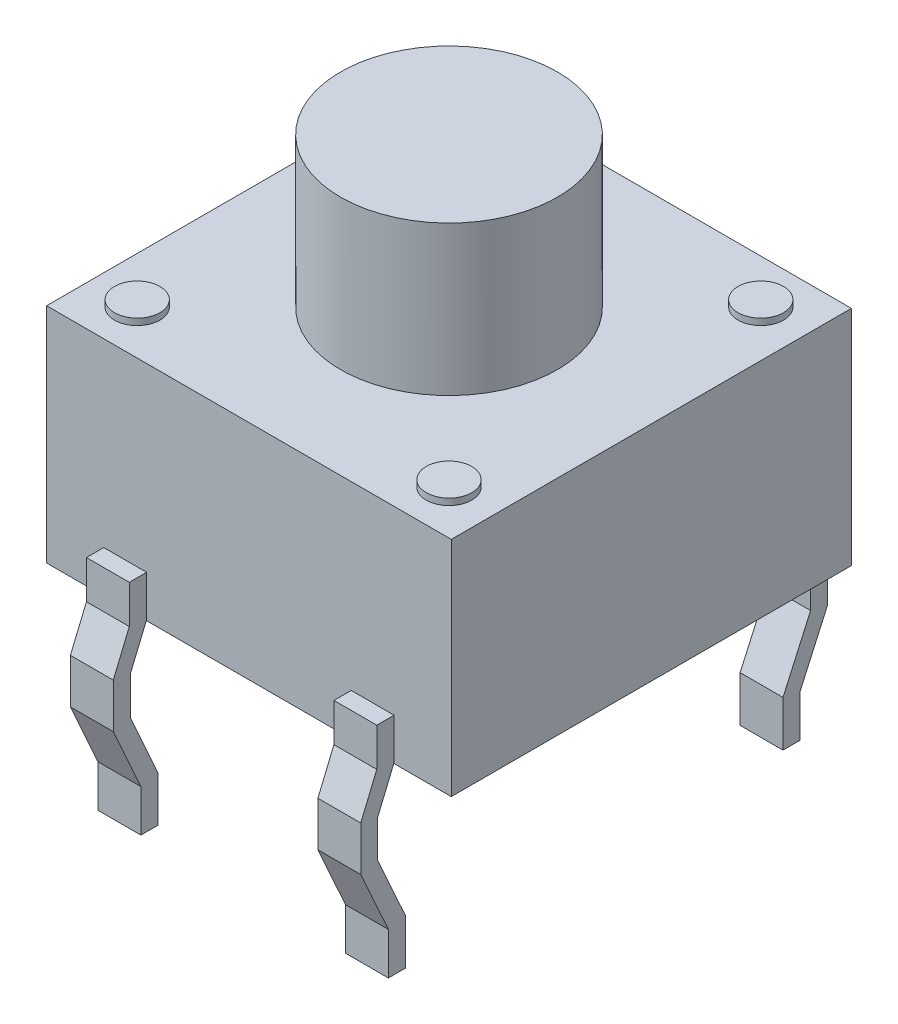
ISO-10303-21;
HEADER;
FILE_DESCRIPTION(('STEP AP214'),'2;1');
FILE_NAME('part.step','',(''),(''),'','','');
FILE_SCHEMA(('AUTOMOTIVE_DESIGN { 1 0 10303 214 1 1 1 1 }'));
ENDSEC;
DATA;
#1=APPLICATION_CONTEXT('core data for automotive mechanical design processes');
#2=APPLICATION_PROTOCOL_DEFINITION('international standard','automotive_design',2000,#1);
#3=PRODUCT_CONTEXT('',#1,'mechanical');
#4=PRODUCT('Part','Part','',(#3));
#5=PRODUCT_RELATED_PRODUCT_CATEGORY('part','',(#4));
#6=PRODUCT_DEFINITION_FORMATION('','',#4);
#7=PRODUCT_DEFINITION_CONTEXT('part definition',#1,'design');
#8=PRODUCT_DEFINITION('design','',#6,#7);
#9=PRODUCT_DEFINITION_SHAPE('','',#8);
#10=(LENGTH_UNIT() NAMED_UNIT(*) SI_UNIT(.MILLI.,.METRE.));
#11=(NAMED_UNIT(*) PLANE_ANGLE_UNIT() SI_UNIT($,.RADIAN.));
#12=(NAMED_UNIT(*) SI_UNIT($,.STERADIAN.) SOLID_ANGLE_UNIT());
#13=UNCERTAINTY_MEASURE_WITH_UNIT(LENGTH_MEASURE(1.E-05),#10,'distance_accuracy_value','');
#14=(GEOMETRIC_REPRESENTATION_CONTEXT(3) GLOBAL_UNCERTAINTY_ASSIGNED_CONTEXT((#13)) GLOBAL_UNIT_ASSIGNED_CONTEXT((#10,
#11,#12)) REPRESENTATION_CONTEXT('',''));
#15=CARTESIAN_POINT('',(0.,0.,0.));
#16=DIRECTION('',(0.,0.,1.));
#17=DIRECTION('',(1.,0.,0.));
#18=AXIS2_PLACEMENT_3D('',#15,#16,#17);
#19=CARTESIAN_POINT('',(-3.115,3.43,-3.08));
#20=DIRECTION('',(0.,-1.,0.));
#21=DIRECTION('',(0.,0.,-1.));
#22=AXIS2_PLACEMENT_3D('',#19,#20,#21);
#23=PLANE('',#22);
#24=CARTESIAN_POINT('',(-2.40002529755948,3.43,-2.40002529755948));
#25=DIRECTION('',(0.,-1.,0.));
#26=DIRECTION('',(0.,0.,-1.));
#27=AXIS2_PLACEMENT_3D('',#24,#25,#26);
#28=CIRCLE('',#27,0.350000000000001);
#29=CARTESIAN_POINT('',(-2.40002529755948,3.43,-2.75002529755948));
#30=VERTEX_POINT('',#29);
#31=EDGE_CURVE('E63',#30,#30,#28,.F.);
#32=ORIENTED_EDGE('',*,*,#31,.F.);
#33=EDGE_LOOP('',(#32));
#34=FACE_BOUND('',#33,.T.);
#35=CARTESIAN_POINT('',(2.40002529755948,3.43,2.40002529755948));
#36=DIRECTION('',(0.,-1.,0.));
#37=DIRECTION('',(0.,0.,-1.));
#38=AXIS2_PLACEMENT_3D('',#35,#36,#37);
#39=CIRCLE('',#38,0.350000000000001);
#40=CARTESIAN_POINT('',(2.40002529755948,3.43,2.05002529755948));
#41=VERTEX_POINT('',#40);
#42=EDGE_CURVE('E942',#41,#41,#39,.F.);
#43=ORIENTED_EDGE('',*,*,#42,.F.);
#44=EDGE_LOOP('',(#43));
#45=FACE_BOUND('',#44,.T.);
#46=DIRECTION('',(0.,0.,1.));
#47=VECTOR('',#46,1.);
#48=CARTESIAN_POINT('',(-3.115,3.43,3.08));
#49=LINE('',#48,#47);
#50=CARTESIAN_POINT('',(-3.115,3.43,-3.08));
#51=VERTEX_POINT('',#50);
#52=CARTESIAN_POINT('',(-3.115,3.43,3.08));
#53=VERTEX_POINT('',#52);
#54=EDGE_CURVE('E918',#51,#53,#49,.T.);
#55=ORIENTED_EDGE('',*,*,#54,.T.);
#56=DIRECTION('',(1.,0.,0.));
#57=VECTOR('',#56,1.);
#58=CARTESIAN_POINT('',(-3.115,3.43,3.08));
#59=LINE('',#58,#57);
#60=CARTESIAN_POINT('',(3.115,3.43,3.08));
#61=VERTEX_POINT('',#60);
#62=EDGE_CURVE('E921',#53,#61,#59,.T.);
#63=ORIENTED_EDGE('',*,*,#62,.T.);
#64=DIRECTION('',(0.,0.,-1.));
#65=VECTOR('',#64,1.);
#66=CARTESIAN_POINT('',(3.115,3.43,3.08));
#67=LINE('',#66,#65);
#68=CARTESIAN_POINT('',(3.115,3.43,-3.08));
#69=VERTEX_POINT('',#68);
#70=EDGE_CURVE('E923',#61,#69,#67,.T.);
#71=ORIENTED_EDGE('',*,*,#70,.T.);
#72=DIRECTION('',(-1.,0.,0.));
#73=VECTOR('',#72,1.);
#74=CARTESIAN_POINT('',(-3.115,3.43,-3.08));
#75=LINE('',#74,#73);
#76=EDGE_CURVE('E925',#69,#51,#75,.T.);
#77=ORIENTED_EDGE('',*,*,#76,.T.);
#78=EDGE_LOOP('',(#55,#63,#71,#77));
#79=FACE_BOUND('',#78,.T.);
#80=CARTESIAN_POINT('',(0.,3.43,0.));
#81=DIRECTION('',(0.,-1.,0.));
#82=DIRECTION('',(0.,0.,-1.));
#83=AXIS2_PLACEMENT_3D('',#80,#81,#82);
#84=CIRCLE('',#83,1.67);
#85=CARTESIAN_POINT('',(0.,3.43,-1.67));
#86=VERTEX_POINT('',#85);
#87=EDGE_CURVE('E939',#86,#86,#84,.F.);
#88=ORIENTED_EDGE('',*,*,#87,.F.);
#89=EDGE_LOOP('',(#88));
#90=FACE_BOUND('',#89,.T.);
#91=CARTESIAN_POINT('',(2.40002529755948,3.43,-2.40002529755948));
#92=DIRECTION('',(0.,-1.,0.));
#93=DIRECTION('',(0.,0.,-1.));
#94=AXIS2_PLACEMENT_3D('',#91,#92,#93);
#95=CIRCLE('',#94,0.350000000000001);
#96=CARTESIAN_POINT('',(2.40002529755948,3.43,-2.75002529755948));
#97=VERTEX_POINT('',#96);
#98=EDGE_CURVE('E945',#97,#97,#95,.F.);
#99=ORIENTED_EDGE('',*,*,#98,.F.);
#100=EDGE_LOOP('',(#99));
#101=FACE_BOUND('',#100,.T.);
#102=CARTESIAN_POINT('',(-2.40002529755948,3.43,2.40002529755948));
#103=DIRECTION('',(0.,-1.,0.));
#104=DIRECTION('',(0.,0.,-1.));
#105=AXIS2_PLACEMENT_3D('',#102,#103,#104);
#106=CIRCLE('',#105,0.350000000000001);
#107=CARTESIAN_POINT('',(-2.40002529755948,3.43,2.05002529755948));
#108=VERTEX_POINT('',#107);
#109=EDGE_CURVE('E12',#108,#108,#106,.F.);
#110=ORIENTED_EDGE('',*,*,#109,.F.);
#111=EDGE_LOOP('',(#110));
#112=FACE_BOUND('',#111,.T.);
#113=ADVANCED_FACE('F55',(#34,#45,#79,#90,#101,#112),#23,.F.);
#114=CARTESIAN_POINT('',(-3.115,3.43,-3.08));
#115=DIRECTION('',(0.,0.,1.));
#116=DIRECTION('',(1.,0.,0.));
#117=AXIS2_PLACEMENT_3D('',#114,#115,#116);
#118=PLANE('',#117);
#119=DIRECTION('',(-1.,0.,0.));
#120=VECTOR('',#119,1.);
#121=CARTESIAN_POINT('',(-3.115,0.,-3.08));
#122=LINE('',#121,#120);
#123=CARTESIAN_POINT('',(3.115,0.,-3.08));
#124=VERTEX_POINT('',#123);
#125=CARTESIAN_POINT('',(-3.115,0.,-3.08));
#126=VERTEX_POINT('',#125);
#127=EDGE_CURVE('E916',#124,#126,#122,.T.);
#128=ORIENTED_EDGE('',*,*,#127,.T.);
#129=DIRECTION('',(0.,-1.,0.));
#130=VECTOR('',#129,1.);
#131=CARTESIAN_POINT('',(-3.115,3.43,-3.08));
#132=LINE('',#131,#130);
#133=EDGE_CURVE('E927',#51,#126,#132,.T.);
#134=ORIENTED_EDGE('',*,*,#133,.F.);
#135=ORIENTED_EDGE('',*,*,#76,.F.);
#136=DIRECTION('',(0.,-1.,0.));
#137=VECTOR('',#136,1.);
#138=CARTESIAN_POINT('',(3.115,3.43,-3.08));
#139=LINE('',#138,#137);
#140=EDGE_CURVE('E930',#69,#124,#139,.T.);
#141=ORIENTED_EDGE('',*,*,#140,.T.);
#142=EDGE_LOOP('',(#128,#134,#135,#141));
#143=FACE_BOUND('',#142,.T.);
#144=DIRECTION('',(-1.,0.,0.));
#145=VECTOR('',#144,1.);
#146=CARTESIAN_POINT('',(1.575,0.645886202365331,-3.08));
#147=LINE('',#146,#145);
#148=CARTESIAN_POINT('',(2.235,0.645886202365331,-3.08));
#149=VERTEX_POINT('',#148);
#150=CARTESIAN_POINT('',(1.575,0.645886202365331,-3.08));
#151=VERTEX_POINT('',#150);
#152=EDGE_CURVE('E586',#149,#151,#147,.T.);
#153=ORIENTED_EDGE('',*,*,#152,.T.);
#154=DIRECTION('',(0.,-1.,0.));
#155=VECTOR('',#154,1.);
#156=CARTESIAN_POINT('',(1.575,0.645886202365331,-3.08));
#157=LINE('',#156,#155);
#158=CARTESIAN_POINT('',(1.575,0.384426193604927,-3.08));
#159=VERTEX_POINT('',#158);
#160=EDGE_CURVE('E583',#151,#159,#157,.T.);
#161=ORIENTED_EDGE('',*,*,#160,.T.);
#162=DIRECTION('',(1.,0.,0.));
#163=VECTOR('',#162,1.);
#164=CARTESIAN_POINT('',(1.575,0.384426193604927,-3.08));
#165=LINE('',#164,#163);
#166=CARTESIAN_POINT('',(2.235,0.384426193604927,-3.08));
#167=VERTEX_POINT('',#166);
#168=EDGE_CURVE('E593',#159,#167,#165,.T.);
#169=ORIENTED_EDGE('',*,*,#168,.T.);
#170=DIRECTION('',(0.,1.,0.));
#171=VECTOR('',#170,1.);
#172=CARTESIAN_POINT('',(2.235,0.645886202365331,-3.08));
#173=LINE('',#172,#171);
#174=EDGE_CURVE('E590',#167,#149,#173,.T.);
#175=ORIENTED_EDGE('',*,*,#174,.T.);
#176=EDGE_LOOP('',(#153,#161,#169,#175));
#177=FACE_BOUND('',#176,.T.);
#178=DIRECTION('',(1.,0.,0.));
#179=VECTOR('',#178,1.);
#180=CARTESIAN_POINT('',(-1.575,0.645886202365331,-3.08));
#181=LINE('',#180,#179);
#182=CARTESIAN_POINT('',(-2.235,0.645886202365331,-3.08));
#183=VERTEX_POINT('',#182);
#184=CARTESIAN_POINT('',(-1.575,0.645886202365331,-3.08));
#185=VERTEX_POINT('',#184);
#186=EDGE_CURVE('E70',#183,#185,#181,.T.);
#187=ORIENTED_EDGE('',*,*,#186,.F.);
#188=DIRECTION('',(0.,1.,0.));
#189=VECTOR('',#188,1.);
#190=CARTESIAN_POINT('',(-2.235,0.645886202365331,-3.08));
#191=LINE('',#190,#189);
#192=CARTESIAN_POINT('',(-2.235,0.384426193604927,-3.08));
#193=VERTEX_POINT('',#192);
#194=EDGE_CURVE('E75',#193,#183,#191,.T.);
#195=ORIENTED_EDGE('',*,*,#194,.F.);
#196=DIRECTION('',(-1.,0.,0.));
#197=VECTOR('',#196,1.);
#198=CARTESIAN_POINT('',(-1.575,0.384426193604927,-3.08));
#199=LINE('',#198,#197);
#200=CARTESIAN_POINT('',(-1.575,0.384426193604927,-3.08));
#201=VERTEX_POINT('',#200);
#202=EDGE_CURVE('E429',#201,#193,#199,.T.);
#203=ORIENTED_EDGE('',*,*,#202,.F.);
#204=DIRECTION('',(0.,-1.,0.));
#205=VECTOR('',#204,1.);
#206=CARTESIAN_POINT('',(-1.575,0.645886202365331,-3.08));
#207=LINE('',#206,#205);
#208=EDGE_CURVE('E433',#185,#201,#207,.T.);
#209=ORIENTED_EDGE('',*,*,#208,.F.);
#210=EDGE_LOOP('',(#187,#195,#203,#209));
#211=FACE_BOUND('',#210,.T.);
#212=ADVANCED_FACE('F431',(#143,#177,#211),#118,.F.);
#213=CARTESIAN_POINT('',(-3.115,3.43,3.08));
#214=DIRECTION('',(0.,0.,-1.));
#215=DIRECTION('',(-1.,0.,0.));
#216=AXIS2_PLACEMENT_3D('',#213,#214,#215);
#217=PLANE('',#216);
#218=DIRECTION('',(1.,0.,0.));
#219=VECTOR('',#218,1.);
#220=CARTESIAN_POINT('',(-1.575,0.645886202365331,3.08));
#221=LINE('',#220,#219);
#222=CARTESIAN_POINT('',(-2.235,0.645886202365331,3.08));
#223=VERTEX_POINT('',#222);
#224=CARTESIAN_POINT('',(-1.575,0.645886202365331,3.08));
#225=VERTEX_POINT('',#224);
#226=EDGE_CURVE('E706',#223,#225,#221,.T.);
#227=ORIENTED_EDGE('',*,*,#226,.T.);
#228=DIRECTION('',(0.,-1.,0.));
#229=VECTOR('',#228,1.);
#230=CARTESIAN_POINT('',(-1.575,0.645886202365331,3.08));
#231=LINE('',#230,#229);
#232=CARTESIAN_POINT('',(-1.575,0.384426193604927,3.08));
#233=VERTEX_POINT('',#232);
#234=EDGE_CURVE('E661',#225,#233,#231,.T.);
#235=ORIENTED_EDGE('',*,*,#234,.T.);
#236=DIRECTION('',(-1.,0.,0.));
#237=VECTOR('',#236,1.);
#238=CARTESIAN_POINT('',(-1.575,0.384426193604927,3.08));
#239=LINE('',#238,#237);
#240=CARTESIAN_POINT('',(-2.235,0.384426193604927,3.08));
#241=VERTEX_POINT('',#240);
#242=EDGE_CURVE('E712',#233,#241,#239,.T.);
#243=ORIENTED_EDGE('',*,*,#242,.T.);
#244=DIRECTION('',(0.,1.,0.));
#245=VECTOR('',#244,1.);
#246=CARTESIAN_POINT('',(-2.235,0.645886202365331,3.08));
#247=LINE('',#246,#245);
#248=EDGE_CURVE('E709',#241,#223,#247,.T.);
#249=ORIENTED_EDGE('',*,*,#248,.T.);
#250=EDGE_LOOP('',(#227,#235,#243,#249));
#251=FACE_BOUND('',#250,.T.);
#252=DIRECTION('',(1.,0.,0.));
#253=VECTOR('',#252,1.);
#254=CARTESIAN_POINT('',(-3.115,0.,3.08));
#255=LINE('',#254,#253);
#256=CARTESIAN_POINT('',(-3.115,0.,3.08));
#257=VERTEX_POINT('',#256);
#258=CARTESIAN_POINT('',(3.115,0.,3.08));
#259=VERTEX_POINT('',#258);
#260=EDGE_CURVE('E912',#257,#259,#255,.T.);
#261=ORIENTED_EDGE('',*,*,#260,.T.);
#262=DIRECTION('',(0.,-1.,0.));
#263=VECTOR('',#262,1.);
#264=CARTESIAN_POINT('',(3.115,3.43,3.08));
#265=LINE('',#264,#263);
#266=EDGE_CURVE('E933',#61,#259,#265,.T.);
#267=ORIENTED_EDGE('',*,*,#266,.F.);
#268=ORIENTED_EDGE('',*,*,#62,.F.);
#269=DIRECTION('',(0.,-1.,0.));
#270=VECTOR('',#269,1.);
#271=CARTESIAN_POINT('',(-3.115,3.43,3.08));
#272=LINE('',#271,#270);
#273=EDGE_CURVE('E936',#53,#257,#272,.T.);
#274=ORIENTED_EDGE('',*,*,#273,.T.);
#275=EDGE_LOOP('',(#261,#267,#268,#274));
#276=FACE_BOUND('',#275,.T.);
#277=DIRECTION('',(-1.,0.,0.));
#278=VECTOR('',#277,1.);
#279=CARTESIAN_POINT('',(1.575,0.645886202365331,3.08));
#280=LINE('',#279,#278);
#281=CARTESIAN_POINT('',(2.235,0.645886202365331,3.08));
#282=VERTEX_POINT('',#281);
#283=CARTESIAN_POINT('',(1.575,0.645886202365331,3.08));
#284=VERTEX_POINT('',#283);
#285=EDGE_CURVE('E834',#282,#284,#280,.T.);
#286=ORIENTED_EDGE('',*,*,#285,.F.);
#287=DIRECTION('',(0.,1.,0.));
#288=VECTOR('',#287,1.);
#289=CARTESIAN_POINT('',(2.235,0.645886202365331,3.08));
#290=LINE('',#289,#288);
#291=CARTESIAN_POINT('',(2.235,0.384426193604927,3.08));
#292=VERTEX_POINT('',#291);
#293=EDGE_CURVE('E831',#292,#282,#290,.T.);
#294=ORIENTED_EDGE('',*,*,#293,.F.);
#295=DIRECTION('',(1.,0.,0.));
#296=VECTOR('',#295,1.);
#297=CARTESIAN_POINT('',(1.575,0.384426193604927,3.08));
#298=LINE('',#297,#296);
#299=CARTESIAN_POINT('',(1.575,0.384426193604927,3.08));
#300=VERTEX_POINT('',#299);
#301=EDGE_CURVE('E828',#300,#292,#298,.T.);
#302=ORIENTED_EDGE('',*,*,#301,.F.);
#303=DIRECTION('',(0.,-1.,0.));
#304=VECTOR('',#303,1.);
#305=CARTESIAN_POINT('',(1.575,0.645886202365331,3.08));
#306=LINE('',#305,#304);
#307=EDGE_CURVE('E780',#284,#300,#306,.T.);
#308=ORIENTED_EDGE('',*,*,#307,.F.);
#309=EDGE_LOOP('',(#286,#294,#302,#308));
#310=FACE_BOUND('',#309,.T.);
#311=ADVANCED_FACE('F1252',(#251,#276,#310),#217,.F.);
#312=CARTESIAN_POINT('',(-3.115,3.43,3.08));
#313=DIRECTION('',(1.,0.,0.));
#314=DIRECTION('',(0.,0.,-1.));
#315=AXIS2_PLACEMENT_3D('',#312,#313,#314);
#316=PLANE('',#315);
#317=DIRECTION('',(0.,0.,1.));
#318=VECTOR('',#317,1.);
#319=CARTESIAN_POINT('',(-3.115,0.,3.08));
#320=LINE('',#319,#318);
#321=EDGE_CURVE('E909',#126,#257,#320,.T.);
#322=ORIENTED_EDGE('',*,*,#321,.T.);
#323=ORIENTED_EDGE('',*,*,#273,.F.);
#324=ORIENTED_EDGE('',*,*,#54,.F.);
#325=ORIENTED_EDGE('',*,*,#133,.T.);
#326=EDGE_LOOP('',(#322,#323,#324,#325));
#327=FACE_BOUND('',#326,.T.);
#328=ADVANCED_FACE('F57',(#327),#316,.F.);
#329=CARTESIAN_POINT('',(3.115,3.43,3.08));
#330=DIRECTION('',(-1.,0.,0.));
#331=DIRECTION('',(0.,0.,1.));
#332=AXIS2_PLACEMENT_3D('',#329,#330,#331);
#333=PLANE('',#332);
#334=DIRECTION('',(0.,0.,-1.));
#335=VECTOR('',#334,1.);
#336=CARTESIAN_POINT('',(3.115,0.,3.08));
#337=LINE('',#336,#335);
#338=EDGE_CURVE('E914',#259,#124,#337,.T.);
#339=ORIENTED_EDGE('',*,*,#338,.T.);
#340=ORIENTED_EDGE('',*,*,#140,.F.);
#341=ORIENTED_EDGE('',*,*,#70,.F.);
#342=ORIENTED_EDGE('',*,*,#266,.T.);
#343=EDGE_LOOP('',(#339,#340,#341,#342));
#344=FACE_BOUND('',#343,.T.);
#345=ADVANCED_FACE('F1247',(#344),#333,.F.);
#346=CARTESIAN_POINT('',(-3.115,0.,-3.08));
#347=DIRECTION('',(0.,-1.,0.));
#348=DIRECTION('',(0.,0.,-1.));
#349=AXIS2_PLACEMENT_3D('',#346,#347,#348);
#350=PLANE('',#349);
#351=ORIENTED_EDGE('',*,*,#321,.F.);
#352=ORIENTED_EDGE('',*,*,#127,.F.);
#353=ORIENTED_EDGE('',*,*,#338,.F.);
#354=ORIENTED_EDGE('',*,*,#260,.F.);
#355=EDGE_LOOP('',(#351,#352,#353,#354));
#356=FACE_BOUND('',#355,.T.);
#357=ADVANCED_FACE('F1244',(#356),#350,.T.);
#358=CARTESIAN_POINT('',(0.,5.73,0.));
#359=DIRECTION('',(0.,-1.,0.));
#360=DIRECTION('',(0.,0.,-1.));
#361=AXIS2_PLACEMENT_3D('',#358,#359,#360);
#362=CYLINDRICAL_SURFACE('',#361,1.67);
#363=CARTESIAN_POINT('',(0.,5.73,0.));
#364=DIRECTION('',(0.,1.,0.));
#365=DIRECTION('',(0.,0.,1.));
#366=AXIS2_PLACEMENT_3D('',#363,#364,#365);
#367=CIRCLE('',#366,1.67);
#368=CARTESIAN_POINT('',(0.,5.73,1.67));
#369=VERTEX_POINT('',#368);
#370=EDGE_CURVE('E784',#369,#369,#367,.T.);
#371=ORIENTED_EDGE('',*,*,#370,.F.);
#372=EDGE_LOOP('',(#371));
#373=FACE_BOUND('',#372,.T.);
#374=ORIENTED_EDGE('',*,*,#87,.T.);
#375=EDGE_LOOP('',(#374));
#376=FACE_BOUND('',#375,.T.);
#377=ADVANCED_FACE('F1240',(#373,#376),#362,.T.);
#378=CARTESIAN_POINT('',(0.,5.73,0.));
#379=DIRECTION('',(0.,1.,0.));
#380=DIRECTION('',(0.,0.,1.));
#381=AXIS2_PLACEMENT_3D('',#378,#379,#380);
#382=PLANE('',#381);
#383=ORIENTED_EDGE('',*,*,#370,.T.);
#384=EDGE_LOOP('',(#383));
#385=FACE_BOUND('',#384,.T.);
#386=ADVANCED_FACE('F1233',(#385),#382,.T.);
#387=CARTESIAN_POINT('',(1.575,-2.11005964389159,2.90682182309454));
#388=DIRECTION('',(0.,0.,-1.));
#389=DIRECTION('',(-1.,0.,0.));
#390=AXIS2_PLACEMENT_3D('',#387,#388,#389);
#391=PLANE('',#390);
#392=DIRECTION('',(0.,-1.,0.));
#393=VECTOR('',#392,1.);
#394=CARTESIAN_POINT('',(2.235,-2.11005964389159,2.90682182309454));
#395=LINE('',#394,#393);
#396=CARTESIAN_POINT('',(2.235,-2.11005964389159,2.90682182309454));
#397=VERTEX_POINT('',#396);
#398=CARTESIAN_POINT('',(2.235,-2.81378627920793,2.90682182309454));
#399=VERTEX_POINT('',#398);
#400=EDGE_CURVE('E902',#397,#399,#395,.T.);
#401=ORIENTED_EDGE('',*,*,#400,.T.);
#402=DIRECTION('',(-1.,0.,0.));
#403=VECTOR('',#402,1.);
#404=CARTESIAN_POINT('',(1.575,-2.81378627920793,2.90682182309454));
#405=LINE('',#404,#403);
#406=CARTESIAN_POINT('',(1.575,-2.81378627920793,2.90682182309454));
#407=VERTEX_POINT('',#406);
#408=EDGE_CURVE('E788',#399,#407,#405,.T.);
#409=ORIENTED_EDGE('',*,*,#408,.T.);
#410=DIRECTION('',(0.,-1.,0.));
#411=VECTOR('',#410,1.);
#412=CARTESIAN_POINT('',(1.575,-2.11005964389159,2.90682182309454));
#413=LINE('',#412,#411);
#414=CARTESIAN_POINT('',(1.575,-2.11005964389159,2.90682182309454));
#415=VERTEX_POINT('',#414);
#416=EDGE_CURVE('E799',#415,#407,#413,.T.);
#417=ORIENTED_EDGE('',*,*,#416,.F.);
#418=DIRECTION('',(1.,0.,0.));
#419=VECTOR('',#418,1.);
#420=CARTESIAN_POINT('',(1.575,-2.11005964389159,2.90682182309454));
#421=LINE('',#420,#419);
#422=EDGE_CURVE('E795',#415,#397,#421,.T.);
#423=ORIENTED_EDGE('',*,*,#422,.T.);
#424=EDGE_LOOP('',(#401,#409,#417,#423));
#425=FACE_BOUND('',#424,.T.);
#426=ADVANCED_FACE('F1230',(#425),#391,.T.);
#427=CARTESIAN_POINT('',(1.575,-2.16619332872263,3.16828183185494));
#428=DIRECTION('',(0.,0.,1.));
#429=DIRECTION('',(1.,0.,0.));
#430=AXIS2_PLACEMENT_3D('',#427,#428,#429);
#431=PLANE('',#430);
#432=DIRECTION('',(0.,-1.,0.));
#433=VECTOR('',#432,1.);
#434=CARTESIAN_POINT('',(1.575,-2.16619332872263,3.16828183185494));
#435=LINE('',#434,#433);
#436=CARTESIAN_POINT('',(1.575,-2.16619332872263,3.16828183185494));
#437=VERTEX_POINT('',#436);
#438=CARTESIAN_POINT('',(1.575,-2.81378627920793,3.16828183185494));
#439=VERTEX_POINT('',#438);
#440=EDGE_CURVE('E896',#437,#439,#435,.T.);
#441=ORIENTED_EDGE('',*,*,#440,.T.);
#442=DIRECTION('',(1.,0.,0.));
#443=VECTOR('',#442,1.);
#444=CARTESIAN_POINT('',(1.575,-2.81378627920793,3.16828183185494));
#445=LINE('',#444,#443);
#446=CARTESIAN_POINT('',(2.235,-2.81378627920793,3.16828183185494));
#447=VERTEX_POINT('',#446);
#448=EDGE_CURVE('E781',#439,#447,#445,.T.);
#449=ORIENTED_EDGE('',*,*,#448,.T.);
#450=DIRECTION('',(0.,-1.,0.));
#451=VECTOR('',#450,1.);
#452=CARTESIAN_POINT('',(2.235,-2.16619332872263,3.16828183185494));
#453=LINE('',#452,#451);
#454=CARTESIAN_POINT('',(2.235,-2.16619332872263,3.16828183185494));
#455=VERTEX_POINT('',#454);
#456=EDGE_CURVE('E899',#455,#447,#453,.T.);
#457=ORIENTED_EDGE('',*,*,#456,.F.);
#458=DIRECTION('',(-1.,0.,0.));
#459=VECTOR('',#458,1.);
#460=CARTESIAN_POINT('',(1.575,-2.16619332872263,3.16828183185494));
#461=LINE('',#460,#459);
#462=EDGE_CURVE('E792',#455,#437,#461,.T.);
#463=ORIENTED_EDGE('',*,*,#462,.T.);
#464=EDGE_LOOP('',(#441,#449,#457,#463));
#465=FACE_BOUND('',#464,.T.);
#466=ADVANCED_FACE('F1225',(#465),#431,.T.);
#467=CARTESIAN_POINT('',(1.575,-1.16565595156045,3.33193052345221));
#468=DIRECTION('',(0.,-0.41046668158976,0.911875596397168));
#469=DIRECTION('',(0.,-0.911875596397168,-0.41046668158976));
#470=AXIS2_PLACEMENT_3D('',#467,#468,#469);
#471=PLANE('',#470);
#472=ORIENTED_EDGE('',*,*,#422,.F.);
#473=DIRECTION('',(0.,-0.911875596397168,-0.41046668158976));
#474=VECTOR('',#473,1.);
#475=CARTESIAN_POINT('',(1.575,-1.16565595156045,3.33193052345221));
#476=LINE('',#475,#474);
#477=CARTESIAN_POINT('',(1.575,-1.16565595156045,3.33193052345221));
#478=VERTEX_POINT('',#477);
#479=EDGE_CURVE('E803',#478,#415,#476,.T.);
#480=ORIENTED_EDGE('',*,*,#479,.F.);
#481=DIRECTION('',(-1.,0.,0.));
#482=VECTOR('',#481,1.);
#483=CARTESIAN_POINT('',(1.575,-1.16565595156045,3.33193052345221));
#484=LINE('',#483,#482);
#485=CARTESIAN_POINT('',(2.235,-1.16565595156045,3.33193052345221));
#486=VERTEX_POINT('',#485);
#487=EDGE_CURVE('E804',#486,#478,#484,.T.);
#488=ORIENTED_EDGE('',*,*,#487,.F.);
#489=DIRECTION('',(0.,-0.911875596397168,-0.41046668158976));
#490=VECTOR('',#489,1.);
#491=CARTESIAN_POINT('',(2.235,-1.16565595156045,3.33193052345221));
#492=LINE('',#491,#490);
#493=EDGE_CURVE('E796',#486,#397,#492,.T.);
#494=ORIENTED_EDGE('',*,*,#493,.T.);
#495=EDGE_LOOP('',(#472,#480,#488,#494));
#496=FACE_BOUND('',#495,.T.);
#497=ADVANCED_FACE('F1222',(#496),#471,.F.);
#498=CARTESIAN_POINT('',(1.575,-1.22178963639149,3.59339053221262));
#499=DIRECTION('',(0.,0.41046668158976,-0.911875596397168));
#500=DIRECTION('',(0.,0.911875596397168,0.41046668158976));
#501=AXIS2_PLACEMENT_3D('',#498,#499,#500);
#502=PLANE('',#501);
#503=ORIENTED_EDGE('',*,*,#462,.F.);
#504=DIRECTION('',(0.,-0.911875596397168,-0.41046668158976));
#505=VECTOR('',#504,1.);
#506=CARTESIAN_POINT('',(2.235,-1.22178963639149,3.59339053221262));
#507=LINE('',#506,#505);
#508=CARTESIAN_POINT('',(2.235,-1.22178963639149,3.59339053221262));
#509=VERTEX_POINT('',#508);
#510=EDGE_CURVE('E889',#509,#455,#507,.T.);
#511=ORIENTED_EDGE('',*,*,#510,.F.);
#512=DIRECTION('',(1.,0.,0.));
#513=VECTOR('',#512,1.);
#514=CARTESIAN_POINT('',(1.575,-1.22178963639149,3.59339053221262));
#515=LINE('',#514,#513);
#516=CARTESIAN_POINT('',(1.575,-1.22178963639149,3.59339053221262));
#517=VERTEX_POINT('',#516);
#518=EDGE_CURVE('E800',#517,#509,#515,.T.);
#519=ORIENTED_EDGE('',*,*,#518,.F.);
#520=DIRECTION('',(0.,-0.911875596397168,-0.41046668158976));
#521=VECTOR('',#520,1.);
#522=CARTESIAN_POINT('',(1.575,-1.22178963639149,3.59339053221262));
#523=LINE('',#522,#521);
#524=EDGE_CURVE('E886',#517,#437,#523,.T.);
#525=ORIENTED_EDGE('',*,*,#524,.T.);
#526=EDGE_LOOP('',(#503,#511,#519,#525));
#527=FACE_BOUND('',#526,.T.);
#528=ADVANCED_FACE('F1217',(#527),#502,.F.);
#529=CARTESIAN_POINT('',(1.575,-0.53453060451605,3.59339053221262));
#530=DIRECTION('',(0.,0.,1.));
#531=DIRECTION('',(1.,0.,0.));
#532=AXIS2_PLACEMENT_3D('',#529,#530,#531);
#533=PLANE('',#532);
#534=DIRECTION('',(0.,-1.,0.));
#535=VECTOR('',#534,1.);
#536=CARTESIAN_POINT('',(1.575,-0.53453060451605,3.59339053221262));
#537=LINE('',#536,#535);
#538=CARTESIAN_POINT('',(1.575,-0.53453060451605,3.59339053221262));
#539=VERTEX_POINT('',#538);
#540=EDGE_CURVE('E870',#539,#517,#537,.T.);
#541=ORIENTED_EDGE('',*,*,#540,.T.);
#542=ORIENTED_EDGE('',*,*,#518,.T.);
#543=DIRECTION('',(0.,-1.,0.));
#544=VECTOR('',#543,1.);
#545=CARTESIAN_POINT('',(2.235,-0.53453060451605,3.59339053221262));
#546=LINE('',#545,#544);
#547=CARTESIAN_POINT('',(2.235,-0.53453060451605,3.59339053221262));
#548=VERTEX_POINT('',#547);
#549=EDGE_CURVE('E873',#548,#509,#546,.T.);
#550=ORIENTED_EDGE('',*,*,#549,.F.);
#551=DIRECTION('',(-1.,0.,0.));
#552=VECTOR('',#551,1.);
#553=CARTESIAN_POINT('',(1.575,-0.53453060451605,3.59339053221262));
#554=LINE('',#553,#552);
#555=EDGE_CURVE('E805',#548,#539,#554,.T.);
#556=ORIENTED_EDGE('',*,*,#555,.T.);
#557=EDGE_LOOP('',(#541,#542,#550,#556));
#558=FACE_BOUND('',#557,.T.);
#559=ADVANCED_FACE('F1214',(#558),#533,.T.);
#560=CARTESIAN_POINT('',(1.575,-0.586904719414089,3.33193052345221));
#561=DIRECTION('',(0.,0.,-1.));
#562=DIRECTION('',(-1.,0.,0.));
#563=AXIS2_PLACEMENT_3D('',#560,#561,#562);
#564=PLANE('',#563);
#565=DIRECTION('',(0.,-1.,0.));
#566=VECTOR('',#565,1.);
#567=CARTESIAN_POINT('',(2.235,-0.586904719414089,3.33193052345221));
#568=LINE('',#567,#566);
#569=CARTESIAN_POINT('',(2.235,-0.586904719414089,3.33193052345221));
#570=VERTEX_POINT('',#569);
#571=EDGE_CURVE('E876',#570,#486,#568,.T.);
#572=ORIENTED_EDGE('',*,*,#571,.T.);
#573=ORIENTED_EDGE('',*,*,#487,.T.);
#574=DIRECTION('',(0.,-1.,0.));
#575=VECTOR('',#574,1.);
#576=CARTESIAN_POINT('',(1.575,-0.586904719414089,3.33193052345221));
#577=LINE('',#576,#575);
#578=CARTESIAN_POINT('',(1.575,-0.586904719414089,3.33193052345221));
#579=VERTEX_POINT('',#578);
#580=EDGE_CURVE('E879',#579,#478,#577,.T.);
#581=ORIENTED_EDGE('',*,*,#580,.F.);
#582=DIRECTION('',(1.,0.,0.));
#583=VECTOR('',#582,1.);
#584=CARTESIAN_POINT('',(1.575,-0.586904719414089,3.33193052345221));
#585=LINE('',#584,#583);
#586=EDGE_CURVE('E808',#579,#570,#585,.T.);
#587=ORIENTED_EDGE('',*,*,#586,.T.);
#588=EDGE_LOOP('',(#572,#573,#581,#587));
#589=FACE_BOUND('',#588,.T.);
#590=ADVANCED_FACE('F1209',(#589),#564,.T.);
#591=CARTESIAN_POINT('',(1.575,0.0565481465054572,3.34668867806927));
#592=DIRECTION('',(0.,-0.385172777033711,-0.922844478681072));
#593=DIRECTION('',(0.,0.922844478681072,-0.385172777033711));
#594=AXIS2_PLACEMENT_3D('',#591,#592,#593);
#595=PLANE('',#594);
#596=ORIENTED_EDGE('',*,*,#555,.F.);
#597=DIRECTION('',(0.,-0.922844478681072,0.385172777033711));
#598=VECTOR('',#597,1.);
#599=CARTESIAN_POINT('',(2.235,0.0565481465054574,3.34668867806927));
#600=LINE('',#599,#598);
#601=CARTESIAN_POINT('',(2.235,0.0565481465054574,3.34668867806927));
#602=VERTEX_POINT('',#601);
#603=EDGE_CURVE('E860',#602,#548,#600,.T.);
#604=ORIENTED_EDGE('',*,*,#603,.F.);
#605=DIRECTION('',(1.,0.,0.));
#606=VECTOR('',#605,1.);
#607=CARTESIAN_POINT('',(1.575,0.0565481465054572,3.34668867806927));
#608=LINE('',#607,#606);
#609=CARTESIAN_POINT('',(1.575,0.0565481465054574,3.34668867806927));
#610=VERTEX_POINT('',#609);
#611=EDGE_CURVE('E814',#610,#602,#608,.T.);
#612=ORIENTED_EDGE('',*,*,#611,.F.);
#613=DIRECTION('',(0.,-0.922844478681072,0.385172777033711));
#614=VECTOR('',#613,1.);
#615=CARTESIAN_POINT('',(1.575,0.0565481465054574,3.34668867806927));
#616=LINE('',#615,#614);
#617=EDGE_CURVE('E813',#610,#539,#616,.T.);
#618=ORIENTED_EDGE('',*,*,#617,.T.);
#619=EDGE_LOOP('',(#596,#604,#612,#618));
#620=FACE_BOUND('',#619,.T.);
#621=ADVANCED_FACE('F1206',(#620),#595,.F.);
#622=CARTESIAN_POINT('',(1.575,0.00417403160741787,3.08522866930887));
#623=DIRECTION('',(0.,0.385172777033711,0.922844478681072));
#624=DIRECTION('',(0.,-0.922844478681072,0.385172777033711));
#625=AXIS2_PLACEMENT_3D('',#622,#623,#624);
#626=PLANE('',#625);
#627=ORIENTED_EDGE('',*,*,#586,.F.);
#628=DIRECTION('',(0.,-0.922844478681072,0.385172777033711));
#629=VECTOR('',#628,1.);
#630=CARTESIAN_POINT('',(1.575,0.00417403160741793,3.08522866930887));
#631=LINE('',#630,#629);
#632=CARTESIAN_POINT('',(1.575,0.00417403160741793,3.08522866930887));
#633=VERTEX_POINT('',#632);
#634=EDGE_CURVE('E809',#633,#579,#631,.T.);
#635=ORIENTED_EDGE('',*,*,#634,.F.);
#636=DIRECTION('',(-1.,0.,0.));
#637=VECTOR('',#636,1.);
#638=CARTESIAN_POINT('',(1.575,0.00417403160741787,3.08522866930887));
#639=LINE('',#638,#637);
#640=CARTESIAN_POINT('',(2.235,0.00417403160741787,3.08522866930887));
#641=VERTEX_POINT('',#640);
#642=EDGE_CURVE('E810',#641,#633,#639,.T.);
#643=ORIENTED_EDGE('',*,*,#642,.F.);
#644=DIRECTION('',(0.,-0.922844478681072,0.385172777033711));
#645=VECTOR('',#644,1.);
#646=CARTESIAN_POINT('',(2.235,0.00417403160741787,3.08522866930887));
#647=LINE('',#646,#645);
#648=EDGE_CURVE('E863',#641,#570,#647,.T.);
#649=ORIENTED_EDGE('',*,*,#648,.T.);
#650=EDGE_LOOP('',(#627,#635,#643,#649));
#651=FACE_BOUND('',#650,.T.);
#652=ADVANCED_FACE('F1201',(#651),#626,.F.);
#653=CARTESIAN_POINT('',(1.575,0.645886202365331,3.34668867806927));
#654=DIRECTION('',(0.,0.,1.));
#655=DIRECTION('',(1.,0.,0.));
#656=AXIS2_PLACEMENT_3D('',#653,#654,#655);
#657=PLANE('',#656);
#658=DIRECTION('',(0.,-1.,0.));
#659=VECTOR('',#658,1.);
#660=CARTESIAN_POINT('',(1.575,0.645886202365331,3.34668867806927));
#661=LINE('',#660,#659);
#662=CARTESIAN_POINT('',(1.575,0.645886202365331,3.34668867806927));
#663=VERTEX_POINT('',#662);
#664=EDGE_CURVE('E817',#663,#610,#661,.T.);
#665=ORIENTED_EDGE('',*,*,#664,.T.);
#666=ORIENTED_EDGE('',*,*,#611,.T.);
#667=DIRECTION('',(0.,-1.,0.));
#668=VECTOR('',#667,1.);
#669=CARTESIAN_POINT('',(2.235,0.645886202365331,3.34668867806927));
#670=LINE('',#669,#668);
#671=CARTESIAN_POINT('',(2.235,0.645886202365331,3.34668867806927));
#672=VERTEX_POINT('',#671);
#673=EDGE_CURVE('E825',#672,#602,#670,.T.);
#674=ORIENTED_EDGE('',*,*,#673,.F.);
#675=DIRECTION('',(-1.,0.,0.));
#676=VECTOR('',#675,1.);
#677=CARTESIAN_POINT('',(1.575,0.645886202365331,3.34668867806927));
#678=LINE('',#677,#676);
#679=EDGE_CURVE('E821',#672,#663,#678,.T.);
#680=ORIENTED_EDGE('',*,*,#679,.T.);
#681=EDGE_LOOP('',(#665,#666,#674,#680));
#682=FACE_BOUND('',#681,.T.);
#683=ADVANCED_FACE('F1198',(#682),#657,.T.);
#684=CARTESIAN_POINT('',(1.575,0.384426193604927,3.08522866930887));
#685=DIRECTION('',(0.,0.,-1.));
#686=DIRECTION('',(-1.,0.,0.));
#687=AXIS2_PLACEMENT_3D('',#684,#685,#686);
#688=PLANE('',#687);
#689=DIRECTION('',(0.,-1.,0.));
#690=VECTOR('',#689,1.);
#691=CARTESIAN_POINT('',(2.235,0.384426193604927,3.08522866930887));
#692=LINE('',#691,#690);
#693=CARTESIAN_POINT('',(2.235,0.384426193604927,3.08522866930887));
#694=VERTEX_POINT('',#693);
#695=EDGE_CURVE('E850',#694,#641,#692,.T.);
#696=ORIENTED_EDGE('',*,*,#695,.T.);
#697=ORIENTED_EDGE('',*,*,#642,.T.);
#698=DIRECTION('',(0.,-1.,0.));
#699=VECTOR('',#698,1.);
#700=CARTESIAN_POINT('',(1.575,0.384426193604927,3.08522866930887));
#701=LINE('',#700,#699);
#702=CARTESIAN_POINT('',(1.575,0.384426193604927,3.08522866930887));
#703=VERTEX_POINT('',#702);
#704=EDGE_CURVE('E853',#703,#633,#701,.T.);
#705=ORIENTED_EDGE('',*,*,#704,.F.);
#706=DIRECTION('',(1.,0.,0.));
#707=VECTOR('',#706,1.);
#708=CARTESIAN_POINT('',(1.575,0.384426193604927,3.08522866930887));
#709=LINE('',#708,#707);
#710=EDGE_CURVE('E818',#703,#694,#709,.T.);
#711=ORIENTED_EDGE('',*,*,#710,.T.);
#712=EDGE_LOOP('',(#696,#697,#705,#711));
#713=FACE_BOUND('',#712,.T.);
#714=ADVANCED_FACE('F1186',(#713),#688,.T.);
#715=CARTESIAN_POINT('',(1.575,0.645886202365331,3.92586101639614));
#716=DIRECTION('',(0.,-1.,0.));
#717=DIRECTION('',(0.,0.,-1.));
#718=AXIS2_PLACEMENT_3D('',#715,#716,#717);
#719=PLANE('',#718);
#720=ORIENTED_EDGE('',*,*,#679,.F.);
#721=DIRECTION('',(0.,0.,-1.));
#722=VECTOR('',#721,1.);
#723=CARTESIAN_POINT('',(2.235,0.645886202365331,3.92586101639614));
#724=LINE('',#723,#722);
#725=EDGE_CURVE('E840',#672,#282,#724,.T.);
#726=ORIENTED_EDGE('',*,*,#725,.T.);
#727=ORIENTED_EDGE('',*,*,#285,.T.);
#728=DIRECTION('',(0.,0.,-1.));
#729=VECTOR('',#728,1.);
#730=CARTESIAN_POINT('',(1.575,0.645886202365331,3.92586101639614));
#731=LINE('',#730,#729);
#732=EDGE_CURVE('E837',#663,#284,#731,.T.);
#733=ORIENTED_EDGE('',*,*,#732,.F.);
#734=EDGE_LOOP('',(#720,#726,#727,#733));
#735=FACE_BOUND('',#734,.T.);
#736=ADVANCED_FACE('F1182',(#735),#719,.F.);
#737=CARTESIAN_POINT('',(2.235,0.645886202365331,3.92586101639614));
#738=DIRECTION('',(-1.,0.,0.));
#739=DIRECTION('',(0.,0.,1.));
#740=AXIS2_PLACEMENT_3D('',#737,#738,#739);
#741=PLANE('',#740);
#742=ORIENTED_EDGE('',*,*,#725,.F.);
#743=ORIENTED_EDGE('',*,*,#673,.T.);
#744=ORIENTED_EDGE('',*,*,#603,.T.);
#745=ORIENTED_EDGE('',*,*,#549,.T.);
#746=ORIENTED_EDGE('',*,*,#510,.T.);
#747=ORIENTED_EDGE('',*,*,#456,.T.);
#748=DIRECTION('',(0.,0.,-1.));
#749=VECTOR('',#748,1.);
#750=CARTESIAN_POINT('',(2.235,-2.81378627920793,3.5364957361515));
#751=LINE('',#750,#749);
#752=EDGE_CURVE('E791',#447,#399,#751,.T.);
#753=ORIENTED_EDGE('',*,*,#752,.T.);
#754=ORIENTED_EDGE('',*,*,#400,.F.);
#755=ORIENTED_EDGE('',*,*,#493,.F.);
#756=ORIENTED_EDGE('',*,*,#571,.F.);
#757=ORIENTED_EDGE('',*,*,#648,.F.);
#758=ORIENTED_EDGE('',*,*,#695,.F.);
#759=DIRECTION('',(0.,0.,-1.));
#760=VECTOR('',#759,1.);
#761=CARTESIAN_POINT('',(2.235,0.384426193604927,3.92586101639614));
#762=LINE('',#761,#760);
#763=EDGE_CURVE('E843',#694,#292,#762,.T.);
#764=ORIENTED_EDGE('',*,*,#763,.T.);
#765=ORIENTED_EDGE('',*,*,#293,.T.);
#766=EDGE_LOOP('',(#742,#743,#744,#745,#746,#747,#753,#754,#755,#756,#757,#758,#764,#765));
#767=FACE_BOUND('',#766,.T.);
#768=ADVANCED_FACE('F1185',(#767),#741,.F.);
#769=CARTESIAN_POINT('',(1.575,0.384426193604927,3.92586101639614));
#770=DIRECTION('',(0.,1.,0.));
#771=DIRECTION('',(0.,0.,1.));
#772=AXIS2_PLACEMENT_3D('',#769,#770,#771);
#773=PLANE('',#772);
#774=ORIENTED_EDGE('',*,*,#710,.F.);
#775=DIRECTION('',(0.,0.,-1.));
#776=VECTOR('',#775,1.);
#777=CARTESIAN_POINT('',(1.575,0.384426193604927,3.92586101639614));
#778=LINE('',#777,#776);
#779=EDGE_CURVE('E822',#703,#300,#778,.T.);
#780=ORIENTED_EDGE('',*,*,#779,.T.);
#781=ORIENTED_EDGE('',*,*,#301,.T.);
#782=ORIENTED_EDGE('',*,*,#763,.F.);
#783=EDGE_LOOP('',(#774,#780,#781,#782));
#784=FACE_BOUND('',#783,.T.);
#785=ADVANCED_FACE('F1190',(#784),#773,.F.);
#786=CARTESIAN_POINT('',(1.575,0.645886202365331,3.92586101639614));
#787=DIRECTION('',(1.,0.,0.));
#788=DIRECTION('',(0.,0.,-1.));
#789=AXIS2_PLACEMENT_3D('',#786,#787,#788);
#790=PLANE('',#789);
#791=ORIENTED_EDGE('',*,*,#779,.F.);
#792=ORIENTED_EDGE('',*,*,#704,.T.);
#793=ORIENTED_EDGE('',*,*,#634,.T.);
#794=ORIENTED_EDGE('',*,*,#580,.T.);
#795=ORIENTED_EDGE('',*,*,#479,.T.);
#796=ORIENTED_EDGE('',*,*,#416,.T.);
#797=DIRECTION('',(0.,0.,1.));
#798=VECTOR('',#797,1.);
#799=CARTESIAN_POINT('',(1.575,-2.81378627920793,3.5364957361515));
#800=LINE('',#799,#798);
#801=EDGE_CURVE('E785',#407,#439,#800,.T.);
#802=ORIENTED_EDGE('',*,*,#801,.T.);
#803=ORIENTED_EDGE('',*,*,#440,.F.);
#804=ORIENTED_EDGE('',*,*,#524,.F.);
#805=ORIENTED_EDGE('',*,*,#540,.F.);
#806=ORIENTED_EDGE('',*,*,#617,.F.);
#807=ORIENTED_EDGE('',*,*,#664,.F.);
#808=ORIENTED_EDGE('',*,*,#732,.T.);
#809=ORIENTED_EDGE('',*,*,#307,.T.);
#810=EDGE_LOOP('',(#791,#792,#793,#794,#795,#796,#802,#803,#804,#805,#806,#807,#808,#809));
#811=FACE_BOUND('',#810,.T.);
#812=ADVANCED_FACE('F1180',(#811),#790,.F.);
#813=CARTESIAN_POINT('',(1.905,-2.81378627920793,3.03755182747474));
#814=DIRECTION('',(0.,-1.,0.));
#815=DIRECTION('',(0.,0.,-1.));
#816=AXIS2_PLACEMENT_3D('',#813,#814,#815);
#817=PLANE('',#816);
#818=ORIENTED_EDGE('',*,*,#752,.F.);
#819=ORIENTED_EDGE('',*,*,#448,.F.);
#820=ORIENTED_EDGE('',*,*,#801,.F.);
#821=ORIENTED_EDGE('',*,*,#408,.F.);
#822=EDGE_LOOP('',(#818,#819,#820,#821));
#823=FACE_BOUND('',#822,.T.);
#824=ADVANCED_FACE('F1173',(#823),#817,.T.);
#825=CARTESIAN_POINT('',(-1.575,-2.11005964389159,2.90682182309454));
#826=DIRECTION('',(0.,0.,1.));
#827=DIRECTION('',(1.,0.,0.));
#828=AXIS2_PLACEMENT_3D('',#825,#826,#827);
#829=PLANE('',#828);
#830=DIRECTION('',(1.,0.,0.));
#831=VECTOR('',#830,1.);
#832=CARTESIAN_POINT('',(-1.575,-2.81378627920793,2.90682182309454));
#833=LINE('',#832,#831);
#834=CARTESIAN_POINT('',(-2.235,-2.81378627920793,2.90682182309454));
#835=VERTEX_POINT('',#834);
#836=CARTESIAN_POINT('',(-1.575,-2.81378627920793,2.90682182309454));
#837=VERTEX_POINT('',#836);
#838=EDGE_CURVE('E664',#835,#837,#833,.T.);
#839=ORIENTED_EDGE('',*,*,#838,.F.);
#840=DIRECTION('',(0.,-1.,0.));
#841=VECTOR('',#840,1.);
#842=CARTESIAN_POINT('',(-2.235,-2.11005964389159,2.90682182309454));
#843=LINE('',#842,#841);
#844=CARTESIAN_POINT('',(-2.235,-2.11005964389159,2.90682182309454));
#845=VERTEX_POINT('',#844);
#846=EDGE_CURVE('E771',#845,#835,#843,.T.);
#847=ORIENTED_EDGE('',*,*,#846,.F.);
#848=DIRECTION('',(-1.,0.,0.));
#849=VECTOR('',#848,1.);
#850=CARTESIAN_POINT('',(-1.575,-2.11005964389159,2.90682182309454));
#851=LINE('',#850,#849);
#852=CARTESIAN_POINT('',(-1.575,-2.11005964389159,2.90682182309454));
#853=VERTEX_POINT('',#852);
#854=EDGE_CURVE('E674',#853,#845,#851,.T.);
#855=ORIENTED_EDGE('',*,*,#854,.F.);
#856=DIRECTION('',(0.,-1.,0.));
#857=VECTOR('',#856,1.);
#858=CARTESIAN_POINT('',(-1.575,-2.11005964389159,2.90682182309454));
#859=LINE('',#858,#857);
#860=EDGE_CURVE('E673',#853,#837,#859,.T.);
#861=ORIENTED_EDGE('',*,*,#860,.T.);
#862=EDGE_LOOP('',(#839,#847,#855,#861));
#863=FACE_BOUND('',#862,.T.);
#864=ADVANCED_FACE('F1170',(#863),#829,.F.);
#865=CARTESIAN_POINT('',(-1.575,-2.16619332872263,3.16828183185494));
#866=DIRECTION('',(0.,0.,-1.));
#867=DIRECTION('',(-1.,0.,0.));
#868=AXIS2_PLACEMENT_3D('',#865,#866,#867);
#869=PLANE('',#868);
#870=DIRECTION('',(-1.,0.,0.));
#871=VECTOR('',#870,1.);
#872=CARTESIAN_POINT('',(-1.575,-2.81378627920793,3.16828183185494));
#873=LINE('',#872,#871);
#874=CARTESIAN_POINT('',(-1.575,-2.81378627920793,3.16828183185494));
#875=VERTEX_POINT('',#874);
#876=CARTESIAN_POINT('',(-2.235,-2.81378627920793,3.16828183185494));
#877=VERTEX_POINT('',#876);
#878=EDGE_CURVE('E669',#875,#877,#873,.T.);
#879=ORIENTED_EDGE('',*,*,#878,.F.);
#880=DIRECTION('',(0.,-1.,0.));
#881=VECTOR('',#880,1.);
#882=CARTESIAN_POINT('',(-1.575,-2.16619332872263,3.16828183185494));
#883=LINE('',#882,#881);
#884=CARTESIAN_POINT('',(-1.575,-2.16619332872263,3.16828183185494));
#885=VERTEX_POINT('',#884);
#886=EDGE_CURVE('E665',#885,#875,#883,.T.);
#887=ORIENTED_EDGE('',*,*,#886,.F.);
#888=DIRECTION('',(1.,0.,0.));
#889=VECTOR('',#888,1.);
#890=CARTESIAN_POINT('',(-1.575,-2.16619332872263,3.16828183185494));
#891=LINE('',#890,#889);
#892=CARTESIAN_POINT('',(-2.235,-2.16619332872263,3.16828183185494));
#893=VERTEX_POINT('',#892);
#894=EDGE_CURVE('E670',#893,#885,#891,.T.);
#895=ORIENTED_EDGE('',*,*,#894,.F.);
#896=DIRECTION('',(0.,-1.,0.));
#897=VECTOR('',#896,1.);
#898=CARTESIAN_POINT('',(-2.235,-2.16619332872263,3.16828183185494));
#899=LINE('',#898,#897);
#900=EDGE_CURVE('E774',#893,#877,#899,.T.);
#901=ORIENTED_EDGE('',*,*,#900,.T.);
#902=EDGE_LOOP('',(#879,#887,#895,#901));
#903=FACE_BOUND('',#902,.T.);
#904=ADVANCED_FACE('F1165',(#903),#869,.F.);
#905=CARTESIAN_POINT('',(-1.575,-1.16565595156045,3.33193052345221));
#906=DIRECTION('',(0.,0.41046668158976,-0.911875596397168));
#907=DIRECTION('',(0.,0.911875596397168,0.41046668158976));
#908=AXIS2_PLACEMENT_3D('',#905,#906,#907);
#909=PLANE('',#908);
#910=DIRECTION('',(0.,-0.911875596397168,-0.41046668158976));
#911=VECTOR('',#910,1.);
#912=CARTESIAN_POINT('',(-1.575,-1.16565595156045,3.33193052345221));
#913=LINE('',#912,#911);
#914=CARTESIAN_POINT('',(-1.575,-1.16565595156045,3.33193052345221));
#915=VERTEX_POINT('',#914);
#916=EDGE_CURVE('E677',#915,#853,#913,.T.);
#917=ORIENTED_EDGE('',*,*,#916,.T.);
#918=ORIENTED_EDGE('',*,*,#854,.T.);
#919=DIRECTION('',(0.,-0.911875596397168,-0.41046668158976));
#920=VECTOR('',#919,1.);
#921=CARTESIAN_POINT('',(-2.235,-1.16565595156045,3.33193052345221));
#922=LINE('',#921,#920);
#923=CARTESIAN_POINT('',(-2.235,-1.16565595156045,3.33193052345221));
#924=VERTEX_POINT('',#923);
#925=EDGE_CURVE('E685',#924,#845,#922,.T.);
#926=ORIENTED_EDGE('',*,*,#925,.F.);
#927=DIRECTION('',(1.,0.,0.));
#928=VECTOR('',#927,1.);
#929=CARTESIAN_POINT('',(-1.575,-1.16565595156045,3.33193052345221));
#930=LINE('',#929,#928);
#931=EDGE_CURVE('E681',#924,#915,#930,.T.);
#932=ORIENTED_EDGE('',*,*,#931,.T.);
#933=EDGE_LOOP('',(#917,#918,#926,#932));
#934=FACE_BOUND('',#933,.T.);
#935=ADVANCED_FACE('F1162',(#934),#909,.T.);
#936=CARTESIAN_POINT('',(-1.575,-1.22178963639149,3.59339053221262));
#937=DIRECTION('',(0.,-0.41046668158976,0.911875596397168));
#938=DIRECTION('',(0.,-0.911875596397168,-0.41046668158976));
#939=AXIS2_PLACEMENT_3D('',#936,#937,#938);
#940=PLANE('',#939);
#941=DIRECTION('',(0.,-0.911875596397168,-0.41046668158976));
#942=VECTOR('',#941,1.);
#943=CARTESIAN_POINT('',(-2.235,-1.22178963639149,3.59339053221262));
#944=LINE('',#943,#942);
#945=CARTESIAN_POINT('',(-2.235,-1.22178963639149,3.59339053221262));
#946=VERTEX_POINT('',#945);
#947=EDGE_CURVE('E761',#946,#893,#944,.T.);
#948=ORIENTED_EDGE('',*,*,#947,.T.);
#949=ORIENTED_EDGE('',*,*,#894,.T.);
#950=DIRECTION('',(0.,-0.911875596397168,-0.41046668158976));
#951=VECTOR('',#950,1.);
#952=CARTESIAN_POINT('',(-1.575,-1.22178963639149,3.59339053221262));
#953=LINE('',#952,#951);
#954=CARTESIAN_POINT('',(-1.575,-1.22178963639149,3.59339053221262));
#955=VERTEX_POINT('',#954);
#956=EDGE_CURVE('E764',#955,#885,#953,.T.);
#957=ORIENTED_EDGE('',*,*,#956,.F.);
#958=DIRECTION('',(-1.,0.,0.));
#959=VECTOR('',#958,1.);
#960=CARTESIAN_POINT('',(-1.575,-1.22178963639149,3.59339053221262));
#961=LINE('',#960,#959);
#962=EDGE_CURVE('E678',#955,#946,#961,.T.);
#963=ORIENTED_EDGE('',*,*,#962,.T.);
#964=EDGE_LOOP('',(#948,#949,#957,#963));
#965=FACE_BOUND('',#964,.T.);
#966=ADVANCED_FACE('F1157',(#965),#940,.T.);
#967=CARTESIAN_POINT('',(-1.575,-0.586904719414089,3.33193052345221));
#968=DIRECTION('',(0.,0.,1.));
#969=DIRECTION('',(1.,0.,0.));
#970=AXIS2_PLACEMENT_3D('',#967,#968,#969);
#971=PLANE('',#970);
#972=ORIENTED_EDGE('',*,*,#931,.F.);
#973=DIRECTION('',(0.,-1.,0.));
#974=VECTOR('',#973,1.);
#975=CARTESIAN_POINT('',(-2.235,-0.586904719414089,3.33193052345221));
#976=LINE('',#975,#974);
#977=CARTESIAN_POINT('',(-2.235,-0.586904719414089,3.33193052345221));
#978=VERTEX_POINT('',#977);
#979=EDGE_CURVE('E689',#978,#924,#976,.T.);
#980=ORIENTED_EDGE('',*,*,#979,.F.);
#981=DIRECTION('',(-1.,0.,0.));
#982=VECTOR('',#981,1.);
#983=CARTESIAN_POINT('',(-1.575,-0.586904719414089,3.33193052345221));
#984=LINE('',#983,#982);
#985=CARTESIAN_POINT('',(-1.575,-0.586904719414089,3.33193052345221));
#986=VERTEX_POINT('',#985);
#987=EDGE_CURVE('E690',#986,#978,#984,.T.);
#988=ORIENTED_EDGE('',*,*,#987,.F.);
#989=DIRECTION('',(0.,-1.,0.));
#990=VECTOR('',#989,1.);
#991=CARTESIAN_POINT('',(-1.575,-0.586904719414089,3.33193052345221));
#992=LINE('',#991,#990);
#993=EDGE_CURVE('E682',#986,#915,#992,.T.);
#994=ORIENTED_EDGE('',*,*,#993,.T.);
#995=EDGE_LOOP('',(#972,#980,#988,#994));
#996=FACE_BOUND('',#995,.T.);
#997=ADVANCED_FACE('F1154',(#996),#971,.F.);
#998=CARTESIAN_POINT('',(-1.575,-0.53453060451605,3.59339053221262));
#999=DIRECTION('',(0.,0.,-1.));
#1000=DIRECTION('',(-1.,0.,0.));
#1001=AXIS2_PLACEMENT_3D('',#998,#999,#1000);
#1002=PLANE('',#1001);
#1003=ORIENTED_EDGE('',*,*,#962,.F.);
#1004=DIRECTION('',(0.,-1.,0.));
#1005=VECTOR('',#1004,1.);
#1006=CARTESIAN_POINT('',(-1.575,-0.53453060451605,3.59339053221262));
#1007=LINE('',#1006,#1005);
#1008=CARTESIAN_POINT('',(-1.575,-0.53453060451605,3.59339053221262));
#1009=VERTEX_POINT('',#1008);
#1010=EDGE_CURVE('E754',#1009,#955,#1007,.T.);
#1011=ORIENTED_EDGE('',*,*,#1010,.F.);
#1012=DIRECTION('',(1.,0.,0.));
#1013=VECTOR('',#1012,1.);
#1014=CARTESIAN_POINT('',(-1.575,-0.53453060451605,3.59339053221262));
#1015=LINE('',#1014,#1013);
#1016=CARTESIAN_POINT('',(-2.235,-0.53453060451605,3.59339053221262));
#1017=VERTEX_POINT('',#1016);
#1018=EDGE_CURVE('E686',#1017,#1009,#1015,.T.);
#1019=ORIENTED_EDGE('',*,*,#1018,.F.);
#1020=DIRECTION('',(0.,-1.,0.));
#1021=VECTOR('',#1020,1.);
#1022=CARTESIAN_POINT('',(-2.235,-0.53453060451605,3.59339053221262));
#1023=LINE('',#1022,#1021);
#1024=EDGE_CURVE('E751',#1017,#946,#1023,.T.);
#1025=ORIENTED_EDGE('',*,*,#1024,.T.);
#1026=EDGE_LOOP('',(#1003,#1011,#1019,#1025));
#1027=FACE_BOUND('',#1026,.T.);
#1028=ADVANCED_FACE('F1149',(#1027),#1002,.F.);
#1029=CARTESIAN_POINT('',(-1.575,0.0565481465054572,3.34668867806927));
#1030=DIRECTION('',(0.,0.385172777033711,0.922844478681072));
#1031=DIRECTION('',(0.,-0.922844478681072,0.385172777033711));
#1032=AXIS2_PLACEMENT_3D('',#1029,#1030,#1031);
#1033=PLANE('',#1032);
#1034=DIRECTION('',(0.,-0.922844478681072,0.385172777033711));
#1035=VECTOR('',#1034,1.);
#1036=CARTESIAN_POINT('',(-2.235,0.0565481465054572,3.34668867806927));
#1037=LINE('',#1036,#1035);
#1038=CARTESIAN_POINT('',(-2.235,0.0565481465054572,3.34668867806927));
#1039=VERTEX_POINT('',#1038);
#1040=EDGE_CURVE('E735',#1039,#1017,#1037,.T.);
#1041=ORIENTED_EDGE('',*,*,#1040,.T.);
#1042=ORIENTED_EDGE('',*,*,#1018,.T.);
#1043=DIRECTION('',(0.,-0.922844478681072,0.385172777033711));
#1044=VECTOR('',#1043,1.);
#1045=CARTESIAN_POINT('',(-1.575,0.0565481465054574,3.34668867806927));
#1046=LINE('',#1045,#1044);
#1047=CARTESIAN_POINT('',(-1.575,0.0565481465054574,3.34668867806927));
#1048=VERTEX_POINT('',#1047);
#1049=EDGE_CURVE('E738',#1048,#1009,#1046,.T.);
#1050=ORIENTED_EDGE('',*,*,#1049,.F.);
#1051=DIRECTION('',(-1.,0.,0.));
#1052=VECTOR('',#1051,1.);
#1053=CARTESIAN_POINT('',(-1.575,0.0565481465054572,3.34668867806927));
#1054=LINE('',#1053,#1052);
#1055=EDGE_CURVE('E691',#1048,#1039,#1054,.T.);
#1056=ORIENTED_EDGE('',*,*,#1055,.T.);
#1057=EDGE_LOOP('',(#1041,#1042,#1050,#1056));
#1058=FACE_BOUND('',#1057,.T.);
#1059=ADVANCED_FACE('F1146',(#1058),#1033,.T.);
#1060=CARTESIAN_POINT('',(-1.575,0.00417403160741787,3.08522866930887));
#1061=DIRECTION('',(0.,-0.385172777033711,-0.922844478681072));
#1062=DIRECTION('',(0.,0.922844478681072,-0.385172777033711));
#1063=AXIS2_PLACEMENT_3D('',#1060,#1061,#1062);
#1064=PLANE('',#1063);
#1065=DIRECTION('',(0.,-0.922844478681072,0.385172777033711));
#1066=VECTOR('',#1065,1.);
#1067=CARTESIAN_POINT('',(-1.575,0.00417403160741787,3.08522866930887));
#1068=LINE('',#1067,#1066);
#1069=CARTESIAN_POINT('',(-1.575,0.00417403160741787,3.08522866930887));
#1070=VERTEX_POINT('',#1069);
#1071=EDGE_CURVE('E741',#1070,#986,#1068,.T.);
#1072=ORIENTED_EDGE('',*,*,#1071,.T.);
#1073=ORIENTED_EDGE('',*,*,#987,.T.);
#1074=DIRECTION('',(0.,-0.922844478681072,0.385172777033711));
#1075=VECTOR('',#1074,1.);
#1076=CARTESIAN_POINT('',(-2.235,0.00417403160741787,3.08522866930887));
#1077=LINE('',#1076,#1075);
#1078=CARTESIAN_POINT('',(-2.235,0.00417403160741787,3.08522866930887));
#1079=VERTEX_POINT('',#1078);
#1080=EDGE_CURVE('E744',#1079,#978,#1077,.T.);
#1081=ORIENTED_EDGE('',*,*,#1080,.F.);
#1082=DIRECTION('',(1.,0.,0.));
#1083=VECTOR('',#1082,1.);
#1084=CARTESIAN_POINT('',(-1.575,0.00417403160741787,3.08522866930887));
#1085=LINE('',#1084,#1083);
#1086=EDGE_CURVE('E694',#1079,#1070,#1085,.T.);
#1087=ORIENTED_EDGE('',*,*,#1086,.T.);
#1088=EDGE_LOOP('',(#1072,#1073,#1081,#1087));
#1089=FACE_BOUND('',#1088,.T.);
#1090=ADVANCED_FACE('F1141',(#1089),#1064,.T.);
#1091=CARTESIAN_POINT('',(-1.575,0.645886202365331,3.34668867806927));
#1092=DIRECTION('',(0.,0.,-1.));
#1093=DIRECTION('',(-1.,0.,0.));
#1094=AXIS2_PLACEMENT_3D('',#1091,#1092,#1093);
#1095=PLANE('',#1094);
#1096=ORIENTED_EDGE('',*,*,#1055,.F.);
#1097=DIRECTION('',(0.,-1.,0.));
#1098=VECTOR('',#1097,1.);
#1099=CARTESIAN_POINT('',(-1.575,0.645886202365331,3.34668867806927));
#1100=LINE('',#1099,#1098);
#1101=CARTESIAN_POINT('',(-1.575,0.645886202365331,3.34668867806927));
#1102=VERTEX_POINT('',#1101);
#1103=EDGE_CURVE('E725',#1102,#1048,#1100,.T.);
#1104=ORIENTED_EDGE('',*,*,#1103,.F.);
#1105=DIRECTION('',(1.,0.,0.));
#1106=VECTOR('',#1105,1.);
#1107=CARTESIAN_POINT('',(-1.575,0.645886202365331,3.34668867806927));
#1108=LINE('',#1107,#1106);
#1109=CARTESIAN_POINT('',(-2.235,0.645886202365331,3.34668867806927));
#1110=VERTEX_POINT('',#1109);
#1111=EDGE_CURVE('E699',#1110,#1102,#1108,.T.);
#1112=ORIENTED_EDGE('',*,*,#1111,.F.);
#1113=DIRECTION('',(0.,-1.,0.));
#1114=VECTOR('',#1113,1.);
#1115=CARTESIAN_POINT('',(-2.235,0.645886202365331,3.34668867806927));
#1116=LINE('',#1115,#1114);
#1117=EDGE_CURVE('E703',#1110,#1039,#1116,.T.);
#1118=ORIENTED_EDGE('',*,*,#1117,.T.);
#1119=EDGE_LOOP('',(#1096,#1104,#1112,#1118));
#1120=FACE_BOUND('',#1119,.T.);
#1121=ADVANCED_FACE('F1138',(#1120),#1095,.F.);
#1122=CARTESIAN_POINT('',(-1.575,0.384426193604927,3.08522866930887));
#1123=DIRECTION('',(0.,0.,1.));
#1124=DIRECTION('',(1.,0.,0.));
#1125=AXIS2_PLACEMENT_3D('',#1122,#1123,#1124);
#1126=PLANE('',#1125);
#1127=ORIENTED_EDGE('',*,*,#1086,.F.);
#1128=DIRECTION('',(0.,-1.,0.));
#1129=VECTOR('',#1128,1.);
#1130=CARTESIAN_POINT('',(-2.235,0.384426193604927,3.08522866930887));
#1131=LINE('',#1130,#1129);
#1132=CARTESIAN_POINT('',(-2.235,0.384426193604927,3.08522866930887));
#1133=VERTEX_POINT('',#1132);
#1134=EDGE_CURVE('E695',#1133,#1079,#1131,.T.);
#1135=ORIENTED_EDGE('',*,*,#1134,.F.);
#1136=DIRECTION('',(-1.,0.,0.));
#1137=VECTOR('',#1136,1.);
#1138=CARTESIAN_POINT('',(-1.575,0.384426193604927,3.08522866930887));
#1139=LINE('',#1138,#1137);
#1140=CARTESIAN_POINT('',(-1.575,0.384426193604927,3.08522866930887));
#1141=VERTEX_POINT('',#1140);
#1142=EDGE_CURVE('E696',#1141,#1133,#1139,.T.);
#1143=ORIENTED_EDGE('',*,*,#1142,.F.);
#1144=DIRECTION('',(0.,-1.,0.));
#1145=VECTOR('',#1144,1.);
#1146=CARTESIAN_POINT('',(-1.575,0.384426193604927,3.08522866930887));
#1147=LINE('',#1146,#1145);
#1148=EDGE_CURVE('E728',#1141,#1070,#1147,.T.);
#1149=ORIENTED_EDGE('',*,*,#1148,.T.);
#1150=EDGE_LOOP('',(#1127,#1135,#1143,#1149));
#1151=FACE_BOUND('',#1150,.T.);
#1152=ADVANCED_FACE('F1136',(#1151),#1126,.F.);
#1153=CARTESIAN_POINT('',(-1.575,0.645886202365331,3.92586101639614));
#1154=DIRECTION('',(1.,0.,0.));
#1155=DIRECTION('',(0.,0.,-1.));
#1156=AXIS2_PLACEMENT_3D('',#1153,#1154,#1155);
#1157=PLANE('',#1156);
#1158=DIRECTION('',(0.,0.,-1.));
#1159=VECTOR('',#1158,1.);
#1160=CARTESIAN_POINT('',(-1.575,0.645886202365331,3.92586101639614));
#1161=LINE('',#1160,#1159);
#1162=EDGE_CURVE('E700',#1102,#225,#1161,.T.);
#1163=ORIENTED_EDGE('',*,*,#1162,.F.);
#1164=ORIENTED_EDGE('',*,*,#1103,.T.);
#1165=ORIENTED_EDGE('',*,*,#1049,.T.);
#1166=ORIENTED_EDGE('',*,*,#1010,.T.);
#1167=ORIENTED_EDGE('',*,*,#956,.T.);
#1168=ORIENTED_EDGE('',*,*,#886,.T.);
#1169=DIRECTION('',(0.,0.,1.));
#1170=VECTOR('',#1169,1.);
#1171=CARTESIAN_POINT('',(-1.575,-2.81378627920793,3.5364957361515));
#1172=LINE('',#1171,#1170);
#1173=EDGE_CURVE('E667',#837,#875,#1172,.T.);
#1174=ORIENTED_EDGE('',*,*,#1173,.F.);
#1175=ORIENTED_EDGE('',*,*,#860,.F.);
#1176=ORIENTED_EDGE('',*,*,#916,.F.);
#1177=ORIENTED_EDGE('',*,*,#993,.F.);
#1178=ORIENTED_EDGE('',*,*,#1071,.F.);
#1179=ORIENTED_EDGE('',*,*,#1148,.F.);
#1180=DIRECTION('',(0.,0.,-1.));
#1181=VECTOR('',#1180,1.);
#1182=CARTESIAN_POINT('',(-1.575,0.384426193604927,3.92586101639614));
#1183=LINE('',#1182,#1181);
#1184=EDGE_CURVE('E715',#1141,#233,#1183,.T.);
#1185=ORIENTED_EDGE('',*,*,#1184,.T.);
#1186=ORIENTED_EDGE('',*,*,#234,.F.);
#1187=EDGE_LOOP('',(#1163,#1164,#1165,#1166,#1167,#1168,#1174,#1175,#1176,#1177,#1178,#1179,
#1185,#1186));
#1188=FACE_BOUND('',#1187,.T.);
#1189=ADVANCED_FACE('F1126',(#1188),#1157,.T.);
#1190=CARTESIAN_POINT('',(-1.575,0.384426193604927,3.92586101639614));
#1191=DIRECTION('',(0.,-1.,0.));
#1192=DIRECTION('',(0.,0.,-1.));
#1193=AXIS2_PLACEMENT_3D('',#1190,#1191,#1192);
#1194=PLANE('',#1193);
#1195=ORIENTED_EDGE('',*,*,#1184,.F.);
#1196=ORIENTED_EDGE('',*,*,#1142,.T.);
#1197=DIRECTION('',(0.,0.,-1.));
#1198=VECTOR('',#1197,1.);
#1199=CARTESIAN_POINT('',(-2.235,0.384426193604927,3.92586101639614));
#1200=LINE('',#1199,#1198);
#1201=EDGE_CURVE('E717',#1133,#241,#1200,.T.);
#1202=ORIENTED_EDGE('',*,*,#1201,.T.);
#1203=ORIENTED_EDGE('',*,*,#242,.F.);
#1204=EDGE_LOOP('',(#1195,#1196,#1202,#1203));
#1205=FACE_BOUND('',#1204,.T.);
#1206=ADVANCED_FACE('F1122',(#1205),#1194,.T.);
#1207=CARTESIAN_POINT('',(-2.235,0.645886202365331,3.92586101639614));
#1208=DIRECTION('',(-1.,0.,0.));
#1209=DIRECTION('',(0.,0.,1.));
#1210=AXIS2_PLACEMENT_3D('',#1207,#1208,#1209);
#1211=PLANE('',#1210);
#1212=ORIENTED_EDGE('',*,*,#1201,.F.);
#1213=ORIENTED_EDGE('',*,*,#1134,.T.);
#1214=ORIENTED_EDGE('',*,*,#1080,.T.);
#1215=ORIENTED_EDGE('',*,*,#979,.T.);
#1216=ORIENTED_EDGE('',*,*,#925,.T.);
#1217=ORIENTED_EDGE('',*,*,#846,.T.);
#1218=DIRECTION('',(0.,0.,-1.));
#1219=VECTOR('',#1218,1.);
#1220=CARTESIAN_POINT('',(-2.235,-2.81378627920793,3.5364957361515));
#1221=LINE('',#1220,#1219);
#1222=EDGE_CURVE('E662',#877,#835,#1221,.T.);
#1223=ORIENTED_EDGE('',*,*,#1222,.F.);
#1224=ORIENTED_EDGE('',*,*,#900,.F.);
#1225=ORIENTED_EDGE('',*,*,#947,.F.);
#1226=ORIENTED_EDGE('',*,*,#1024,.F.);
#1227=ORIENTED_EDGE('',*,*,#1040,.F.);
#1228=ORIENTED_EDGE('',*,*,#1117,.F.);
#1229=DIRECTION('',(0.,0.,-1.));
#1230=VECTOR('',#1229,1.);
#1231=CARTESIAN_POINT('',(-2.235,0.645886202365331,3.92586101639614));
#1232=LINE('',#1231,#1230);
#1233=EDGE_CURVE('E719',#1110,#223,#1232,.T.);
#1234=ORIENTED_EDGE('',*,*,#1233,.T.);
#1235=ORIENTED_EDGE('',*,*,#248,.F.);
#1236=EDGE_LOOP('',(#1212,#1213,#1214,#1215,#1216,#1217,#1223,#1224,#1225,#1226,#1227,#1228,
#1234,#1235));
#1237=FACE_BOUND('',#1236,.T.);
#1238=ADVANCED_FACE('F1125',(#1237),#1211,.T.);
#1239=CARTESIAN_POINT('',(-1.575,0.645886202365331,3.92586101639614));
#1240=DIRECTION('',(0.,1.,0.));
#1241=DIRECTION('',(0.,0.,1.));
#1242=AXIS2_PLACEMENT_3D('',#1239,#1240,#1241);
#1243=PLANE('',#1242);
#1244=ORIENTED_EDGE('',*,*,#1233,.F.);
#1245=ORIENTED_EDGE('',*,*,#1111,.T.);
#1246=ORIENTED_EDGE('',*,*,#1162,.T.);
#1247=ORIENTED_EDGE('',*,*,#226,.F.);
#1248=EDGE_LOOP('',(#1244,#1245,#1246,#1247));
#1249=FACE_BOUND('',#1248,.T.);
#1250=ADVANCED_FACE('F1120',(#1249),#1243,.T.);
#1251=CARTESIAN_POINT('',(-1.905,-2.81378627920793,3.03755182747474));
#1252=DIRECTION('',(0.,-1.,0.));
#1253=DIRECTION('',(0.,0.,-1.));
#1254=AXIS2_PLACEMENT_3D('',#1251,#1252,#1253);
#1255=PLANE('',#1254);
#1256=ORIENTED_EDGE('',*,*,#1173,.T.);
#1257=ORIENTED_EDGE('',*,*,#878,.T.);
#1258=ORIENTED_EDGE('',*,*,#1222,.T.);
#1259=ORIENTED_EDGE('',*,*,#838,.T.);
#1260=EDGE_LOOP('',(#1256,#1257,#1258,#1259));
#1261=FACE_BOUND('',#1260,.T.);
#1262=ADVANCED_FACE('F1113',(#1261),#1255,.T.);
#1263=CARTESIAN_POINT('',(1.575,-2.11005964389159,-2.90682182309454));
#1264=DIRECTION('',(0.,0.,-1.));
#1265=DIRECTION('',(-1.,0.,0.));
#1266=AXIS2_PLACEMENT_3D('',#1263,#1264,#1265);
#1267=PLANE('',#1266);
#1268=DIRECTION('',(-1.,0.,0.));
#1269=VECTOR('',#1268,1.);
#1270=CARTESIAN_POINT('',(1.575,-2.81378627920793,-2.90682182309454));
#1271=LINE('',#1270,#1269);
#1272=CARTESIAN_POINT('',(2.235,-2.81378627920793,-2.90682182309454));
#1273=VERTEX_POINT('',#1272);
#1274=CARTESIAN_POINT('',(1.575,-2.81378627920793,-2.90682182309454));
#1275=VERTEX_POINT('',#1274);
#1276=EDGE_CURVE('E543',#1273,#1275,#1271,.T.);
#1277=ORIENTED_EDGE('',*,*,#1276,.F.);
#1278=DIRECTION('',(0.,-1.,0.));
#1279=VECTOR('',#1278,1.);
#1280=CARTESIAN_POINT('',(2.235,-2.11005964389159,-2.90682182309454));
#1281=LINE('',#1280,#1279);
#1282=CARTESIAN_POINT('',(2.235,-2.11005964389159,-2.90682182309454));
#1283=VERTEX_POINT('',#1282);
#1284=EDGE_CURVE('E652',#1283,#1273,#1281,.T.);
#1285=ORIENTED_EDGE('',*,*,#1284,.F.);
#1286=DIRECTION('',(1.,0.,0.));
#1287=VECTOR('',#1286,1.);
#1288=CARTESIAN_POINT('',(1.575,-2.11005964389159,-2.90682182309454));
#1289=LINE('',#1288,#1287);
#1290=CARTESIAN_POINT('',(1.575,-2.11005964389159,-2.90682182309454));
#1291=VERTEX_POINT('',#1290);
#1292=EDGE_CURVE('E553',#1291,#1283,#1289,.T.);
#1293=ORIENTED_EDGE('',*,*,#1292,.F.);
#1294=DIRECTION('',(0.,-1.,0.));
#1295=VECTOR('',#1294,1.);
#1296=CARTESIAN_POINT('',(1.575,-2.11005964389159,-2.90682182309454));
#1297=LINE('',#1296,#1295);
#1298=EDGE_CURVE('E552',#1291,#1275,#1297,.T.);
#1299=ORIENTED_EDGE('',*,*,#1298,.T.);
#1300=EDGE_LOOP('',(#1277,#1285,#1293,#1299));
#1301=FACE_BOUND('',#1300,.T.);
#1302=ADVANCED_FACE('F1110',(#1301),#1267,.F.);
#1303=CARTESIAN_POINT('',(1.575,-2.16619332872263,-3.16828183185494));
#1304=DIRECTION('',(0.,0.,1.));
#1305=DIRECTION('',(1.,0.,0.));
#1306=AXIS2_PLACEMENT_3D('',#1303,#1304,#1305);
#1307=PLANE('',#1306);
#1308=DIRECTION('',(1.,0.,0.));
#1309=VECTOR('',#1308,1.);
#1310=CARTESIAN_POINT('',(1.575,-2.81378627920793,-3.16828183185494));
#1311=LINE('',#1310,#1309);
#1312=CARTESIAN_POINT('',(1.575,-2.81378627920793,-3.16828183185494));
#1313=VERTEX_POINT('',#1312);
#1314=CARTESIAN_POINT('',(2.235,-2.81378627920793,-3.16828183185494));
#1315=VERTEX_POINT('',#1314);
#1316=EDGE_CURVE('E548',#1313,#1315,#1311,.T.);
#1317=ORIENTED_EDGE('',*,*,#1316,.F.);
#1318=DIRECTION('',(0.,-1.,0.));
#1319=VECTOR('',#1318,1.);
#1320=CARTESIAN_POINT('',(1.575,-2.16619332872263,-3.16828183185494));
#1321=LINE('',#1320,#1319);
#1322=CARTESIAN_POINT('',(1.575,-2.16619332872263,-3.16828183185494));
#1323=VERTEX_POINT('',#1322);
#1324=EDGE_CURVE('E544',#1323,#1313,#1321,.T.);
#1325=ORIENTED_EDGE('',*,*,#1324,.F.);
#1326=DIRECTION('',(-1.,0.,0.));
#1327=VECTOR('',#1326,1.);
#1328=CARTESIAN_POINT('',(1.575,-2.16619332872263,-3.16828183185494));
#1329=LINE('',#1328,#1327);
#1330=CARTESIAN_POINT('',(2.235,-2.16619332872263,-3.16828183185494));
#1331=VERTEX_POINT('',#1330);
#1332=EDGE_CURVE('E549',#1331,#1323,#1329,.T.);
#1333=ORIENTED_EDGE('',*,*,#1332,.F.);
#1334=DIRECTION('',(0.,-1.,0.));
#1335=VECTOR('',#1334,1.);
#1336=CARTESIAN_POINT('',(2.235,-2.16619332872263,-3.16828183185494));
#1337=LINE('',#1336,#1335);
#1338=EDGE_CURVE('E655',#1331,#1315,#1337,.T.);
#1339=ORIENTED_EDGE('',*,*,#1338,.T.);
#1340=EDGE_LOOP('',(#1317,#1325,#1333,#1339));
#1341=FACE_BOUND('',#1340,.T.);
#1342=ADVANCED_FACE('F1105',(#1341),#1307,.F.);
#1343=CARTESIAN_POINT('',(1.575,-1.16565595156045,-3.33193052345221));
#1344=DIRECTION('',(0.,0.41046668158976,0.911875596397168));
#1345=DIRECTION('',(0.,-0.911875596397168,0.41046668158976));
#1346=AXIS2_PLACEMENT_3D('',#1343,#1344,#1345);
#1347=PLANE('',#1346);
#1348=DIRECTION('',(0.,-0.911875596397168,0.41046668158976));
#1349=VECTOR('',#1348,1.);
#1350=CARTESIAN_POINT('',(1.575,-1.16565595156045,-3.33193052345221));
#1351=LINE('',#1350,#1349);
#1352=CARTESIAN_POINT('',(1.575,-1.16565595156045,-3.33193052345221));
#1353=VERTEX_POINT('',#1352);
#1354=EDGE_CURVE('E556',#1353,#1291,#1351,.T.);
#1355=ORIENTED_EDGE('',*,*,#1354,.T.);
#1356=ORIENTED_EDGE('',*,*,#1292,.T.);
#1357=DIRECTION('',(0.,-0.911875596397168,0.41046668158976));
#1358=VECTOR('',#1357,1.);
#1359=CARTESIAN_POINT('',(2.235,-1.16565595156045,-3.33193052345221));
#1360=LINE('',#1359,#1358);
#1361=CARTESIAN_POINT('',(2.235,-1.16565595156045,-3.33193052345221));
#1362=VERTEX_POINT('',#1361);
#1363=EDGE_CURVE('E564',#1362,#1283,#1360,.T.);
#1364=ORIENTED_EDGE('',*,*,#1363,.F.);
#1365=DIRECTION('',(-1.,0.,0.));
#1366=VECTOR('',#1365,1.);
#1367=CARTESIAN_POINT('',(1.575,-1.16565595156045,-3.33193052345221));
#1368=LINE('',#1367,#1366);
#1369=EDGE_CURVE('E560',#1362,#1353,#1368,.T.);
#1370=ORIENTED_EDGE('',*,*,#1369,.T.);
#1371=EDGE_LOOP('',(#1355,#1356,#1364,#1370));
#1372=FACE_BOUND('',#1371,.T.);
#1373=ADVANCED_FACE('F1102',(#1372),#1347,.T.);
#1374=CARTESIAN_POINT('',(1.575,-1.22178963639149,-3.59339053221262));
#1375=DIRECTION('',(0.,-0.41046668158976,-0.911875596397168));
#1376=DIRECTION('',(0.,0.911875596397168,-0.41046668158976));
#1377=AXIS2_PLACEMENT_3D('',#1374,#1375,#1376);
#1378=PLANE('',#1377);
#1379=DIRECTION('',(0.,-0.911875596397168,0.41046668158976));
#1380=VECTOR('',#1379,1.);
#1381=CARTESIAN_POINT('',(2.235,-1.22178963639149,-3.59339053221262));
#1382=LINE('',#1381,#1380);
#1383=CARTESIAN_POINT('',(2.235,-1.22178963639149,-3.59339053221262));
#1384=VERTEX_POINT('',#1383);
#1385=EDGE_CURVE('E642',#1384,#1331,#1382,.T.);
#1386=ORIENTED_EDGE('',*,*,#1385,.T.);
#1387=ORIENTED_EDGE('',*,*,#1332,.T.);
#1388=DIRECTION('',(0.,-0.911875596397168,0.41046668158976));
#1389=VECTOR('',#1388,1.);
#1390=CARTESIAN_POINT('',(1.575,-1.22178963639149,-3.59339053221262));
#1391=LINE('',#1390,#1389);
#1392=CARTESIAN_POINT('',(1.575,-1.22178963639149,-3.59339053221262));
#1393=VERTEX_POINT('',#1392);
#1394=EDGE_CURVE('E645',#1393,#1323,#1391,.T.);
#1395=ORIENTED_EDGE('',*,*,#1394,.F.);
#1396=DIRECTION('',(1.,0.,0.));
#1397=VECTOR('',#1396,1.);
#1398=CARTESIAN_POINT('',(1.575,-1.22178963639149,-3.59339053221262));
#1399=LINE('',#1398,#1397);
#1400=EDGE_CURVE('E557',#1393,#1384,#1399,.T.);
#1401=ORIENTED_EDGE('',*,*,#1400,.T.);
#1402=EDGE_LOOP('',(#1386,#1387,#1395,#1401));
#1403=FACE_BOUND('',#1402,.T.);
#1404=ADVANCED_FACE('F1097',(#1403),#1378,.T.);
#1405=CARTESIAN_POINT('',(1.575,-0.586904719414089,-3.33193052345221));
#1406=DIRECTION('',(0.,0.,-1.));
#1407=DIRECTION('',(-1.,0.,0.));
#1408=AXIS2_PLACEMENT_3D('',#1405,#1406,#1407);
#1409=PLANE('',#1408);
#1410=ORIENTED_EDGE('',*,*,#1369,.F.);
#1411=DIRECTION('',(0.,-1.,0.));
#1412=VECTOR('',#1411,1.);
#1413=CARTESIAN_POINT('',(2.235,-0.586904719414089,-3.33193052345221));
#1414=LINE('',#1413,#1412);
#1415=CARTESIAN_POINT('',(2.235,-0.586904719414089,-3.33193052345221));
#1416=VERTEX_POINT('',#1415);
#1417=EDGE_CURVE('E568',#1416,#1362,#1414,.T.);
#1418=ORIENTED_EDGE('',*,*,#1417,.F.);
#1419=DIRECTION('',(1.,0.,0.));
#1420=VECTOR('',#1419,1.);
#1421=CARTESIAN_POINT('',(1.575,-0.586904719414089,-3.33193052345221));
#1422=LINE('',#1421,#1420);
#1423=CARTESIAN_POINT('',(1.575,-0.586904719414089,-3.33193052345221));
#1424=VERTEX_POINT('',#1423);
#1425=EDGE_CURVE('E569',#1424,#1416,#1422,.T.);
#1426=ORIENTED_EDGE('',*,*,#1425,.F.);
#1427=DIRECTION('',(0.,-1.,0.));
#1428=VECTOR('',#1427,1.);
#1429=CARTESIAN_POINT('',(1.575,-0.586904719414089,-3.33193052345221));
#1430=LINE('',#1429,#1428);
#1431=EDGE_CURVE('E561',#1424,#1353,#1430,.T.);
#1432=ORIENTED_EDGE('',*,*,#1431,.T.);
#1433=EDGE_LOOP('',(#1410,#1418,#1426,#1432));
#1434=FACE_BOUND('',#1433,.T.);
#1435=ADVANCED_FACE('F1094',(#1434),#1409,.F.);
#1436=CARTESIAN_POINT('',(1.575,-0.53453060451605,-3.59339053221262));
#1437=DIRECTION('',(0.,0.,1.));
#1438=DIRECTION('',(1.,0.,0.));
#1439=AXIS2_PLACEMENT_3D('',#1436,#1437,#1438);
#1440=PLANE('',#1439);
#1441=ORIENTED_EDGE('',*,*,#1400,.F.);
#1442=DIRECTION('',(0.,-1.,0.));
#1443=VECTOR('',#1442,1.);
#1444=CARTESIAN_POINT('',(1.575,-0.53453060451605,-3.59339053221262));
#1445=LINE('',#1444,#1443);
#1446=CARTESIAN_POINT('',(1.575,-0.53453060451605,-3.59339053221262));
#1447=VERTEX_POINT('',#1446);
#1448=EDGE_CURVE('E635',#1447,#1393,#1445,.T.);
#1449=ORIENTED_EDGE('',*,*,#1448,.F.);
#1450=DIRECTION('',(-1.,0.,0.));
#1451=VECTOR('',#1450,1.);
#1452=CARTESIAN_POINT('',(1.575,-0.53453060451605,-3.59339053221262));
#1453=LINE('',#1452,#1451);
#1454=CARTESIAN_POINT('',(2.235,-0.53453060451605,-3.59339053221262));
#1455=VERTEX_POINT('',#1454);
#1456=EDGE_CURVE('E565',#1455,#1447,#1453,.T.);
#1457=ORIENTED_EDGE('',*,*,#1456,.F.);
#1458=DIRECTION('',(0.,-1.,0.));
#1459=VECTOR('',#1458,1.);
#1460=CARTESIAN_POINT('',(2.235,-0.53453060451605,-3.59339053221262));
#1461=LINE('',#1460,#1459);
#1462=EDGE_CURVE('E632',#1455,#1384,#1461,.T.);
#1463=ORIENTED_EDGE('',*,*,#1462,.T.);
#1464=EDGE_LOOP('',(#1441,#1449,#1457,#1463));
#1465=FACE_BOUND('',#1464,.T.);
#1466=ADVANCED_FACE('F1089',(#1465),#1440,.F.);
#1467=CARTESIAN_POINT('',(1.575,0.0565481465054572,-3.34668867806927));
#1468=DIRECTION('',(0.,0.385172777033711,-0.922844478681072));
#1469=DIRECTION('',(0.,0.922844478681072,0.385172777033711));
#1470=AXIS2_PLACEMENT_3D('',#1467,#1468,#1469);
#1471=PLANE('',#1470);
#1472=DIRECTION('',(0.,-0.922844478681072,-0.385172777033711));
#1473=VECTOR('',#1472,1.);
#1474=CARTESIAN_POINT('',(2.235,0.0565481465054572,-3.34668867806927));
#1475=LINE('',#1474,#1473);
#1476=CARTESIAN_POINT('',(2.235,0.0565481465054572,-3.34668867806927));
#1477=VERTEX_POINT('',#1476);
#1478=EDGE_CURVE('E616',#1477,#1455,#1475,.T.);
#1479=ORIENTED_EDGE('',*,*,#1478,.T.);
#1480=ORIENTED_EDGE('',*,*,#1456,.T.);
#1481=DIRECTION('',(0.,-0.922844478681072,-0.385172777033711));
#1482=VECTOR('',#1481,1.);
#1483=CARTESIAN_POINT('',(1.575,0.0565481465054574,-3.34668867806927));
#1484=LINE('',#1483,#1482);
#1485=CARTESIAN_POINT('',(1.575,0.0565481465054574,-3.34668867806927));
#1486=VERTEX_POINT('',#1485);
#1487=EDGE_CURVE('E619',#1486,#1447,#1484,.T.);
#1488=ORIENTED_EDGE('',*,*,#1487,.F.);
#1489=DIRECTION('',(1.,0.,0.));
#1490=VECTOR('',#1489,1.);
#1491=CARTESIAN_POINT('',(1.575,0.0565481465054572,-3.34668867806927));
#1492=LINE('',#1491,#1490);
#1493=EDGE_CURVE('E570',#1486,#1477,#1492,.T.);
#1494=ORIENTED_EDGE('',*,*,#1493,.T.);
#1495=EDGE_LOOP('',(#1479,#1480,#1488,#1494));
#1496=FACE_BOUND('',#1495,.T.);
#1497=ADVANCED_FACE('F1086',(#1496),#1471,.T.);
#1498=CARTESIAN_POINT('',(1.575,0.00417403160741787,-3.08522866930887));
#1499=DIRECTION('',(0.,-0.385172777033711,0.922844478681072));
#1500=DIRECTION('',(0.,-0.922844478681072,-0.385172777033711));
#1501=AXIS2_PLACEMENT_3D('',#1498,#1499,#1500);
#1502=PLANE('',#1501);
#1503=DIRECTION('',(0.,-0.922844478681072,-0.385172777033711));
#1504=VECTOR('',#1503,1.);
#1505=CARTESIAN_POINT('',(1.575,0.00417403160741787,-3.08522866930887));
#1506=LINE('',#1505,#1504);
#1507=CARTESIAN_POINT('',(1.575,0.00417403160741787,-3.08522866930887));
#1508=VERTEX_POINT('',#1507);
#1509=EDGE_CURVE('E622',#1508,#1424,#1506,.T.);
#1510=ORIENTED_EDGE('',*,*,#1509,.T.);
#1511=ORIENTED_EDGE('',*,*,#1425,.T.);
#1512=DIRECTION('',(0.,-0.922844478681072,-0.385172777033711));
#1513=VECTOR('',#1512,1.);
#1514=CARTESIAN_POINT('',(2.235,0.00417403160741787,-3.08522866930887));
#1515=LINE('',#1514,#1513);
#1516=CARTESIAN_POINT('',(2.235,0.00417403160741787,-3.08522866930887));
#1517=VERTEX_POINT('',#1516);
#1518=EDGE_CURVE('E625',#1517,#1416,#1515,.T.);
#1519=ORIENTED_EDGE('',*,*,#1518,.F.);
#1520=DIRECTION('',(-1.,0.,0.));
#1521=VECTOR('',#1520,1.);
#1522=CARTESIAN_POINT('',(1.575,0.00417403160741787,-3.08522866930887));
#1523=LINE('',#1522,#1521);
#1524=EDGE_CURVE('E573',#1517,#1508,#1523,.T.);
#1525=ORIENTED_EDGE('',*,*,#1524,.T.);
#1526=EDGE_LOOP('',(#1510,#1511,#1519,#1525));
#1527=FACE_BOUND('',#1526,.T.);
#1528=ADVANCED_FACE('F1081',(#1527),#1502,.T.);
#1529=CARTESIAN_POINT('',(1.575,0.645886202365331,-3.34668867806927));
#1530=DIRECTION('',(0.,0.,1.));
#1531=DIRECTION('',(1.,0.,0.));
#1532=AXIS2_PLACEMENT_3D('',#1529,#1530,#1531);
#1533=PLANE('',#1532);
#1534=ORIENTED_EDGE('',*,*,#1493,.F.);
#1535=DIRECTION('',(0.,-1.,0.));
#1536=VECTOR('',#1535,1.);
#1537=CARTESIAN_POINT('',(1.575,0.645886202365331,-3.34668867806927));
#1538=LINE('',#1537,#1536);
#1539=CARTESIAN_POINT('',(1.575,0.645886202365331,-3.34668867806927));
#1540=VERTEX_POINT('',#1539);
#1541=EDGE_CURVE('E606',#1540,#1486,#1538,.T.);
#1542=ORIENTED_EDGE('',*,*,#1541,.F.);
#1543=DIRECTION('',(-1.,0.,0.));
#1544=VECTOR('',#1543,1.);
#1545=CARTESIAN_POINT('',(1.575,0.645886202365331,-3.34668867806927));
#1546=LINE('',#1545,#1544);
#1547=CARTESIAN_POINT('',(2.235,0.645886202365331,-3.34668867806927));
#1548=VERTEX_POINT('',#1547);
#1549=EDGE_CURVE('E578',#1548,#1540,#1546,.T.);
#1550=ORIENTED_EDGE('',*,*,#1549,.F.);
#1551=DIRECTION('',(0.,-1.,0.));
#1552=VECTOR('',#1551,1.);
#1553=CARTESIAN_POINT('',(2.235,0.645886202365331,-3.34668867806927));
#1554=LINE('',#1553,#1552);
#1555=EDGE_CURVE('E582',#1548,#1477,#1554,.T.);
#1556=ORIENTED_EDGE('',*,*,#1555,.T.);
#1557=EDGE_LOOP('',(#1534,#1542,#1550,#1556));
#1558=FACE_BOUND('',#1557,.T.);
#1559=ADVANCED_FACE('F1078',(#1558),#1533,.F.);
#1560=CARTESIAN_POINT('',(1.575,0.384426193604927,-3.08522866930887));
#1561=DIRECTION('',(0.,0.,-1.));
#1562=DIRECTION('',(-1.,0.,0.));
#1563=AXIS2_PLACEMENT_3D('',#1560,#1561,#1562);
#1564=PLANE('',#1563);
#1565=ORIENTED_EDGE('',*,*,#1524,.F.);
#1566=DIRECTION('',(0.,-1.,0.));
#1567=VECTOR('',#1566,1.);
#1568=CARTESIAN_POINT('',(2.235,0.384426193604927,-3.08522866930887));
#1569=LINE('',#1568,#1567);
#1570=CARTESIAN_POINT('',(2.235,0.384426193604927,-3.08522866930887));
#1571=VERTEX_POINT('',#1570);
#1572=EDGE_CURVE('E574',#1571,#1517,#1569,.T.);
#1573=ORIENTED_EDGE('',*,*,#1572,.F.);
#1574=DIRECTION('',(1.,0.,0.));
#1575=VECTOR('',#1574,1.);
#1576=CARTESIAN_POINT('',(1.575,0.384426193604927,-3.08522866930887));
#1577=LINE('',#1576,#1575);
#1578=CARTESIAN_POINT('',(1.575,0.384426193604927,-3.08522866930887));
#1579=VERTEX_POINT('',#1578);
#1580=EDGE_CURVE('E575',#1579,#1571,#1577,.T.);
#1581=ORIENTED_EDGE('',*,*,#1580,.F.);
#1582=DIRECTION('',(0.,-1.,0.));
#1583=VECTOR('',#1582,1.);
#1584=CARTESIAN_POINT('',(1.575,0.384426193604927,-3.08522866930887));
#1585=LINE('',#1584,#1583);
#1586=EDGE_CURVE('E609',#1579,#1508,#1585,.T.);
#1587=ORIENTED_EDGE('',*,*,#1586,.T.);
#1588=EDGE_LOOP('',(#1565,#1573,#1581,#1587));
#1589=FACE_BOUND('',#1588,.T.);
#1590=ADVANCED_FACE('F1076',(#1589),#1564,.F.);
#1591=CARTESIAN_POINT('',(1.575,0.645886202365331,-3.92586101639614));
#1592=DIRECTION('',(-1.,0.,0.));
#1593=DIRECTION('',(0.,0.,1.));
#1594=AXIS2_PLACEMENT_3D('',#1591,#1592,#1593);
#1595=PLANE('',#1594);
#1596=DIRECTION('',(0.,0.,1.));
#1597=VECTOR('',#1596,1.);
#1598=CARTESIAN_POINT('',(1.575,0.645886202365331,-3.92586101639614));
#1599=LINE('',#1598,#1597);
#1600=EDGE_CURVE('E579',#1540,#151,#1599,.T.);
#1601=ORIENTED_EDGE('',*,*,#1600,.F.);
#1602=ORIENTED_EDGE('',*,*,#1541,.T.);
#1603=ORIENTED_EDGE('',*,*,#1487,.T.);
#1604=ORIENTED_EDGE('',*,*,#1448,.T.);
#1605=ORIENTED_EDGE('',*,*,#1394,.T.);
#1606=ORIENTED_EDGE('',*,*,#1324,.T.);
#1607=DIRECTION('',(0.,0.,-1.));
#1608=VECTOR('',#1607,1.);
#1609=CARTESIAN_POINT('',(1.575,-2.81378627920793,-3.5364957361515));
#1610=LINE('',#1609,#1608);
#1611=EDGE_CURVE('E546',#1275,#1313,#1610,.T.);
#1612=ORIENTED_EDGE('',*,*,#1611,.F.);
#1613=ORIENTED_EDGE('',*,*,#1298,.F.);
#1614=ORIENTED_EDGE('',*,*,#1354,.F.);
#1615=ORIENTED_EDGE('',*,*,#1431,.F.);
#1616=ORIENTED_EDGE('',*,*,#1509,.F.);
#1617=ORIENTED_EDGE('',*,*,#1586,.F.);
#1618=DIRECTION('',(0.,0.,1.));
#1619=VECTOR('',#1618,1.);
#1620=CARTESIAN_POINT('',(1.575,0.384426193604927,-3.92586101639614));
#1621=LINE('',#1620,#1619);
#1622=EDGE_CURVE('E596',#1579,#159,#1621,.T.);
#1623=ORIENTED_EDGE('',*,*,#1622,.T.);
#1624=ORIENTED_EDGE('',*,*,#160,.F.);
#1625=EDGE_LOOP('',(#1601,#1602,#1603,#1604,#1605,#1606,#1612,#1613,#1614,#1615,#1616,#1617,
#1623,#1624));
#1626=FACE_BOUND('',#1625,.T.);
#1627=ADVANCED_FACE('F1066',(#1626),#1595,.T.);
#1628=CARTESIAN_POINT('',(1.575,0.384426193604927,-3.92586101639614));
#1629=DIRECTION('',(0.,-1.,0.));
#1630=DIRECTION('',(0.,0.,-1.));
#1631=AXIS2_PLACEMENT_3D('',#1628,#1629,#1630);
#1632=PLANE('',#1631);
#1633=ORIENTED_EDGE('',*,*,#1622,.F.);
#1634=ORIENTED_EDGE('',*,*,#1580,.T.);
#1635=DIRECTION('',(0.,0.,1.));
#1636=VECTOR('',#1635,1.);
#1637=CARTESIAN_POINT('',(2.235,0.384426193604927,-3.92586101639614));
#1638=LINE('',#1637,#1636);
#1639=EDGE_CURVE('E598',#1571,#167,#1638,.T.);
#1640=ORIENTED_EDGE('',*,*,#1639,.T.);
#1641=ORIENTED_EDGE('',*,*,#168,.F.);
#1642=EDGE_LOOP('',(#1633,#1634,#1640,#1641));
#1643=FACE_BOUND('',#1642,.T.);
#1644=ADVANCED_FACE('F1062',(#1643),#1632,.T.);
#1645=CARTESIAN_POINT('',(2.235,0.645886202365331,-3.92586101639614));
#1646=DIRECTION('',(1.,0.,0.));
#1647=DIRECTION('',(0.,0.,-1.));
#1648=AXIS2_PLACEMENT_3D('',#1645,#1646,#1647);
#1649=PLANE('',#1648);
#1650=ORIENTED_EDGE('',*,*,#1639,.F.);
#1651=ORIENTED_EDGE('',*,*,#1572,.T.);
#1652=ORIENTED_EDGE('',*,*,#1518,.T.);
#1653=ORIENTED_EDGE('',*,*,#1417,.T.);
#1654=ORIENTED_EDGE('',*,*,#1363,.T.);
#1655=ORIENTED_EDGE('',*,*,#1284,.T.);
#1656=DIRECTION('',(0.,0.,1.));
#1657=VECTOR('',#1656,1.);
#1658=CARTESIAN_POINT('',(2.235,-2.81378627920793,-3.5364957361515));
#1659=LINE('',#1658,#1657);
#1660=EDGE_CURVE('E541',#1315,#1273,#1659,.T.);
#1661=ORIENTED_EDGE('',*,*,#1660,.F.);
#1662=ORIENTED_EDGE('',*,*,#1338,.F.);
#1663=ORIENTED_EDGE('',*,*,#1385,.F.);
#1664=ORIENTED_EDGE('',*,*,#1462,.F.);
#1665=ORIENTED_EDGE('',*,*,#1478,.F.);
#1666=ORIENTED_EDGE('',*,*,#1555,.F.);
#1667=DIRECTION('',(0.,0.,1.));
#1668=VECTOR('',#1667,1.);
#1669=CARTESIAN_POINT('',(2.235,0.645886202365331,-3.92586101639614));
#1670=LINE('',#1669,#1668);
#1671=EDGE_CURVE('E600',#1548,#149,#1670,.T.);
#1672=ORIENTED_EDGE('',*,*,#1671,.T.);
#1673=ORIENTED_EDGE('',*,*,#174,.F.);
#1674=EDGE_LOOP('',(#1650,#1651,#1652,#1653,#1654,#1655,#1661,#1662,#1663,#1664,#1665,#1666,
#1672,#1673));
#1675=FACE_BOUND('',#1674,.T.);
#1676=ADVANCED_FACE('F1065',(#1675),#1649,.T.);
#1677=CARTESIAN_POINT('',(1.575,0.645886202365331,-3.92586101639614));
#1678=DIRECTION('',(0.,1.,0.));
#1679=DIRECTION('',(0.,0.,1.));
#1680=AXIS2_PLACEMENT_3D('',#1677,#1678,#1679);
#1681=PLANE('',#1680);
#1682=ORIENTED_EDGE('',*,*,#1671,.F.);
#1683=ORIENTED_EDGE('',*,*,#1549,.T.);
#1684=ORIENTED_EDGE('',*,*,#1600,.T.);
#1685=ORIENTED_EDGE('',*,*,#152,.F.);
#1686=EDGE_LOOP('',(#1682,#1683,#1684,#1685));
#1687=FACE_BOUND('',#1686,.T.);
#1688=ADVANCED_FACE('F1060',(#1687),#1681,.T.);
#1689=CARTESIAN_POINT('',(1.905,-2.81378627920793,-3.03755182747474));
#1690=DIRECTION('',(0.,-1.,0.));
#1691=DIRECTION('',(0.,0.,-1.));
#1692=AXIS2_PLACEMENT_3D('',#1689,#1690,#1691);
#1693=PLANE('',#1692);
#1694=ORIENTED_EDGE('',*,*,#1611,.T.);
#1695=ORIENTED_EDGE('',*,*,#1316,.T.);
#1696=ORIENTED_EDGE('',*,*,#1660,.T.);
#1697=ORIENTED_EDGE('',*,*,#1276,.T.);
#1698=EDGE_LOOP('',(#1694,#1695,#1696,#1697));
#1699=FACE_BOUND('',#1698,.T.);
#1700=ADVANCED_FACE('F1053',(#1699),#1693,.T.);
#1701=CARTESIAN_POINT('',(-1.575,-2.11005964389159,-2.90682182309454));
#1702=DIRECTION('',(0.,0.,1.));
#1703=DIRECTION('',(1.,0.,0.));
#1704=AXIS2_PLACEMENT_3D('',#1701,#1702,#1703);
#1705=PLANE('',#1704);
#1706=DIRECTION('',(0.,-1.,0.));
#1707=VECTOR('',#1706,1.);
#1708=CARTESIAN_POINT('',(-2.235,-2.11005964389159,-2.90682182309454));
#1709=LINE('',#1708,#1707);
#1710=CARTESIAN_POINT('',(-2.235,-2.11005964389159,-2.90682182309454));
#1711=VERTEX_POINT('',#1710);
#1712=CARTESIAN_POINT('',(-2.235,-2.81378627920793,-2.90682182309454));
#1713=VERTEX_POINT('',#1712);
#1714=EDGE_CURVE('E534',#1711,#1713,#1709,.T.);
#1715=ORIENTED_EDGE('',*,*,#1714,.T.);
#1716=DIRECTION('',(1.,0.,0.));
#1717=VECTOR('',#1716,1.);
#1718=CARTESIAN_POINT('',(-1.575,-2.81378627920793,-2.90682182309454));
#1719=LINE('',#1718,#1717);
#1720=CARTESIAN_POINT('',(-1.575,-2.81378627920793,-2.90682182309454));
#1721=VERTEX_POINT('',#1720);
#1722=EDGE_CURVE('E540',#1713,#1721,#1719,.T.);
#1723=ORIENTED_EDGE('',*,*,#1722,.T.);
#1724=DIRECTION('',(0.,-1.,0.));
#1725=VECTOR('',#1724,1.);
#1726=CARTESIAN_POINT('',(-1.575,-2.11005964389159,-2.90682182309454));
#1727=LINE('',#1726,#1725);
#1728=CARTESIAN_POINT('',(-1.575,-2.11005964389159,-2.90682182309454));
#1729=VERTEX_POINT('',#1728);
#1730=EDGE_CURVE('E524',#1729,#1721,#1727,.T.);
#1731=ORIENTED_EDGE('',*,*,#1730,.F.);
#1732=DIRECTION('',(-1.,0.,0.));
#1733=VECTOR('',#1732,1.);
#1734=CARTESIAN_POINT('',(-1.575,-2.11005964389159,-2.90682182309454));
#1735=LINE('',#1734,#1733);
#1736=EDGE_CURVE('E528',#1729,#1711,#1735,.T.);
#1737=ORIENTED_EDGE('',*,*,#1736,.T.);
#1738=EDGE_LOOP('',(#1715,#1723,#1731,#1737));
#1739=FACE_BOUND('',#1738,.T.);
#1740=ADVANCED_FACE('F1050',(#1739),#1705,.T.);
#1741=CARTESIAN_POINT('',(-1.575,-2.16619332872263,-3.16828183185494));
#1742=DIRECTION('',(0.,0.,-1.));
#1743=DIRECTION('',(-1.,0.,0.));
#1744=AXIS2_PLACEMENT_3D('',#1741,#1742,#1743);
#1745=PLANE('',#1744);
#1746=DIRECTION('',(0.,-1.,0.));
#1747=VECTOR('',#1746,1.);
#1748=CARTESIAN_POINT('',(-1.575,-2.16619332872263,-3.16828183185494));
#1749=LINE('',#1748,#1747);
#1750=CARTESIAN_POINT('',(-1.575,-2.16619332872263,-3.16828183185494));
#1751=VERTEX_POINT('',#1750);
#1752=CARTESIAN_POINT('',(-1.575,-2.81378627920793,-3.16828183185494));
#1753=VERTEX_POINT('',#1752);
#1754=EDGE_CURVE('E527',#1751,#1753,#1749,.T.);
#1755=ORIENTED_EDGE('',*,*,#1754,.T.);
#1756=DIRECTION('',(-1.,0.,0.));
#1757=VECTOR('',#1756,1.);
#1758=CARTESIAN_POINT('',(-1.575,-2.81378627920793,-3.16828183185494));
#1759=LINE('',#1758,#1757);
#1760=CARTESIAN_POINT('',(-2.235,-2.81378627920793,-3.16828183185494));
#1761=VERTEX_POINT('',#1760);
#1762=EDGE_CURVE('E587',#1753,#1761,#1759,.T.);
#1763=ORIENTED_EDGE('',*,*,#1762,.T.);
#1764=DIRECTION('',(0.,-1.,0.));
#1765=VECTOR('',#1764,1.);
#1766=CARTESIAN_POINT('',(-2.235,-2.16619332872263,-3.16828183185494));
#1767=LINE('',#1766,#1765);
#1768=CARTESIAN_POINT('',(-2.235,-2.16619332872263,-3.16828183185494));
#1769=VERTEX_POINT('',#1768);
#1770=EDGE_CURVE('E531',#1769,#1761,#1767,.T.);
#1771=ORIENTED_EDGE('',*,*,#1770,.F.);
#1772=DIRECTION('',(1.,0.,0.));
#1773=VECTOR('',#1772,1.);
#1774=CARTESIAN_POINT('',(-1.575,-2.16619332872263,-3.16828183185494));
#1775=LINE('',#1774,#1773);
#1776=EDGE_CURVE('E523',#1769,#1751,#1775,.T.);
#1777=ORIENTED_EDGE('',*,*,#1776,.T.);
#1778=EDGE_LOOP('',(#1755,#1763,#1771,#1777));
#1779=FACE_BOUND('',#1778,.T.);
#1780=ADVANCED_FACE('F1045',(#1779),#1745,.T.);
#1781=CARTESIAN_POINT('',(-1.575,-1.16565595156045,-3.33193052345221));
#1782=DIRECTION('',(0.,-0.41046668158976,-0.911875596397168));
#1783=DIRECTION('',(0.,0.911875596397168,-0.41046668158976));
#1784=AXIS2_PLACEMENT_3D('',#1781,#1782,#1783);
#1785=PLANE('',#1784);
#1786=ORIENTED_EDGE('',*,*,#1736,.F.);
#1787=DIRECTION('',(0.,-0.911875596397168,0.41046668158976));
#1788=VECTOR('',#1787,1.);
#1789=CARTESIAN_POINT('',(-1.575,-1.16565595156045,-3.33193052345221));
#1790=LINE('',#1789,#1788);
#1791=CARTESIAN_POINT('',(-1.575,-1.16565595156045,-3.33193052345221));
#1792=VERTEX_POINT('',#1791);
#1793=EDGE_CURVE('E511',#1792,#1729,#1790,.T.);
#1794=ORIENTED_EDGE('',*,*,#1793,.F.);
#1795=DIRECTION('',(1.,0.,0.));
#1796=VECTOR('',#1795,1.);
#1797=CARTESIAN_POINT('',(-1.575,-1.16565595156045,-3.33193052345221));
#1798=LINE('',#1797,#1796);
#1799=CARTESIAN_POINT('',(-2.235,-1.16565595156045,-3.33193052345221));
#1800=VERTEX_POINT('',#1799);
#1801=EDGE_CURVE('E507',#1800,#1792,#1798,.T.);
#1802=ORIENTED_EDGE('',*,*,#1801,.F.);
#1803=DIRECTION('',(0.,-0.911875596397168,0.41046668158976));
#1804=VECTOR('',#1803,1.);
#1805=CARTESIAN_POINT('',(-2.235,-1.16565595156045,-3.33193052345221));
#1806=LINE('',#1805,#1804);
#1807=EDGE_CURVE('E520',#1800,#1711,#1806,.T.);
#1808=ORIENTED_EDGE('',*,*,#1807,.T.);
#1809=EDGE_LOOP('',(#1786,#1794,#1802,#1808));
#1810=FACE_BOUND('',#1809,.T.);
#1811=ADVANCED_FACE('F1042',(#1810),#1785,.F.);
#1812=CARTESIAN_POINT('',(-1.575,-1.22178963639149,-3.59339053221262));
#1813=DIRECTION('',(0.,0.41046668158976,0.911875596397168));
#1814=DIRECTION('',(0.,-0.911875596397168,0.41046668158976));
#1815=AXIS2_PLACEMENT_3D('',#1812,#1813,#1814);
#1816=PLANE('',#1815);
#1817=ORIENTED_EDGE('',*,*,#1776,.F.);
#1818=DIRECTION('',(0.,-0.911875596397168,0.41046668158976));
#1819=VECTOR('',#1818,1.);
#1820=CARTESIAN_POINT('',(-2.235,-1.22178963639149,-3.59339053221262));
#1821=LINE('',#1820,#1819);
#1822=CARTESIAN_POINT('',(-2.235,-1.22178963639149,-3.59339053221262));
#1823=VERTEX_POINT('',#1822);
#1824=EDGE_CURVE('E517',#1823,#1769,#1821,.T.);
#1825=ORIENTED_EDGE('',*,*,#1824,.F.);
#1826=DIRECTION('',(-1.,0.,0.));
#1827=VECTOR('',#1826,1.);
#1828=CARTESIAN_POINT('',(-1.575,-1.22178963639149,-3.59339053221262));
#1829=LINE('',#1828,#1827);
#1830=CARTESIAN_POINT('',(-1.575,-1.22178963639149,-3.59339053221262));
#1831=VERTEX_POINT('',#1830);
#1832=EDGE_CURVE('E510',#1831,#1823,#1829,.T.);
#1833=ORIENTED_EDGE('',*,*,#1832,.F.);
#1834=DIRECTION('',(0.,-0.911875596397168,0.41046668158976));
#1835=VECTOR('',#1834,1.);
#1836=CARTESIAN_POINT('',(-1.575,-1.22178963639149,-3.59339053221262));
#1837=LINE('',#1836,#1835);
#1838=EDGE_CURVE('E514',#1831,#1751,#1837,.T.);
#1839=ORIENTED_EDGE('',*,*,#1838,.T.);
#1840=EDGE_LOOP('',(#1817,#1825,#1833,#1839));
#1841=FACE_BOUND('',#1840,.T.);
#1842=ADVANCED_FACE('F1037',(#1841),#1816,.F.);
#1843=CARTESIAN_POINT('',(-1.575,-0.53453060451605,-3.59339053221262));
#1844=DIRECTION('',(0.,0.,-1.));
#1845=DIRECTION('',(-1.,0.,0.));
#1846=AXIS2_PLACEMENT_3D('',#1843,#1844,#1845);
#1847=PLANE('',#1846);
#1848=DIRECTION('',(0.,-1.,0.));
#1849=VECTOR('',#1848,1.);
#1850=CARTESIAN_POINT('',(-1.575,-0.53453060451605,-3.59339053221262));
#1851=LINE('',#1850,#1849);
#1852=CARTESIAN_POINT('',(-1.575,-0.53453060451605,-3.59339053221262));
#1853=VERTEX_POINT('',#1852);
#1854=EDGE_CURVE('E495',#1853,#1831,#1851,.T.);
#1855=ORIENTED_EDGE('',*,*,#1854,.T.);
#1856=ORIENTED_EDGE('',*,*,#1832,.T.);
#1857=DIRECTION('',(0.,-1.,0.));
#1858=VECTOR('',#1857,1.);
#1859=CARTESIAN_POINT('',(-2.235,-0.53453060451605,-3.59339053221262));
#1860=LINE('',#1859,#1858);
#1861=CARTESIAN_POINT('',(-2.235,-0.53453060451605,-3.59339053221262));
#1862=VERTEX_POINT('',#1861);
#1863=EDGE_CURVE('E498',#1862,#1823,#1860,.T.);
#1864=ORIENTED_EDGE('',*,*,#1863,.F.);
#1865=DIRECTION('',(1.,0.,0.));
#1866=VECTOR('',#1865,1.);
#1867=CARTESIAN_POINT('',(-1.575,-0.53453060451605,-3.59339053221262));
#1868=LINE('',#1867,#1866);
#1869=EDGE_CURVE('E491',#1862,#1853,#1868,.T.);
#1870=ORIENTED_EDGE('',*,*,#1869,.T.);
#1871=EDGE_LOOP('',(#1855,#1856,#1864,#1870));
#1872=FACE_BOUND('',#1871,.T.);
#1873=ADVANCED_FACE('F1034',(#1872),#1847,.T.);
#1874=CARTESIAN_POINT('',(-1.575,-0.586904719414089,-3.33193052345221));
#1875=DIRECTION('',(0.,0.,1.));
#1876=DIRECTION('',(1.,0.,0.));
#1877=AXIS2_PLACEMENT_3D('',#1874,#1875,#1876);
#1878=PLANE('',#1877);
#1879=DIRECTION('',(0.,-1.,0.));
#1880=VECTOR('',#1879,1.);
#1881=CARTESIAN_POINT('',(-2.235,-0.586904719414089,-3.33193052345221));
#1882=LINE('',#1881,#1880);
#1883=CARTESIAN_POINT('',(-2.235,-0.586904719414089,-3.33193052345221));
#1884=VERTEX_POINT('',#1883);
#1885=EDGE_CURVE('E501',#1884,#1800,#1882,.T.);
#1886=ORIENTED_EDGE('',*,*,#1885,.T.);
#1887=ORIENTED_EDGE('',*,*,#1801,.T.);
#1888=DIRECTION('',(0.,-1.,0.));
#1889=VECTOR('',#1888,1.);
#1890=CARTESIAN_POINT('',(-1.575,-0.586904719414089,-3.33193052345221));
#1891=LINE('',#1890,#1889);
#1892=CARTESIAN_POINT('',(-1.575,-0.586904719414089,-3.33193052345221));
#1893=VERTEX_POINT('',#1892);
#1894=EDGE_CURVE('E504',#1893,#1792,#1891,.T.);
#1895=ORIENTED_EDGE('',*,*,#1894,.F.);
#1896=DIRECTION('',(-1.,0.,0.));
#1897=VECTOR('',#1896,1.);
#1898=CARTESIAN_POINT('',(-1.575,-0.586904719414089,-3.33193052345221));
#1899=LINE('',#1898,#1897);
#1900=EDGE_CURVE('E492',#1893,#1884,#1899,.T.);
#1901=ORIENTED_EDGE('',*,*,#1900,.T.);
#1902=EDGE_LOOP('',(#1886,#1887,#1895,#1901));
#1903=FACE_BOUND('',#1902,.T.);
#1904=ADVANCED_FACE('F1029',(#1903),#1878,.T.);
#1905=CARTESIAN_POINT('',(-1.575,0.0565481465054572,-3.34668867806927));
#1906=DIRECTION('',(0.,-0.385172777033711,0.922844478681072));
#1907=DIRECTION('',(0.,-0.922844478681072,-0.385172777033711));
#1908=AXIS2_PLACEMENT_3D('',#1905,#1906,#1907);
#1909=PLANE('',#1908);
#1910=ORIENTED_EDGE('',*,*,#1869,.F.);
#1911=DIRECTION('',(0.,-0.922844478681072,-0.385172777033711));
#1912=VECTOR('',#1911,1.);
#1913=CARTESIAN_POINT('',(-2.235,0.0565481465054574,-3.34668867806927));
#1914=LINE('',#1913,#1912);
#1915=CARTESIAN_POINT('',(-2.235,0.0565481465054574,-3.34668867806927));
#1916=VERTEX_POINT('',#1915);
#1917=EDGE_CURVE('E481',#1916,#1862,#1914,.T.);
#1918=ORIENTED_EDGE('',*,*,#1917,.F.);
#1919=DIRECTION('',(-1.,0.,0.));
#1920=VECTOR('',#1919,1.);
#1921=CARTESIAN_POINT('',(-1.575,0.0565481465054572,-3.34668867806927));
#1922=LINE('',#1921,#1920);
#1923=CARTESIAN_POINT('',(-1.575,0.0565481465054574,-3.34668867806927));
#1924=VERTEX_POINT('',#1923);
#1925=EDGE_CURVE('E477',#1924,#1916,#1922,.T.);
#1926=ORIENTED_EDGE('',*,*,#1925,.F.);
#1927=DIRECTION('',(0.,-0.922844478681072,-0.385172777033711));
#1928=VECTOR('',#1927,1.);
#1929=CARTESIAN_POINT('',(-1.575,0.0565481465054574,-3.34668867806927));
#1930=LINE('',#1929,#1928);
#1931=EDGE_CURVE('E478',#1924,#1853,#1930,.T.);
#1932=ORIENTED_EDGE('',*,*,#1931,.T.);
#1933=EDGE_LOOP('',(#1910,#1918,#1926,#1932));
#1934=FACE_BOUND('',#1933,.T.);
#1935=ADVANCED_FACE('F1026',(#1934),#1909,.F.);
#1936=CARTESIAN_POINT('',(-1.575,0.00417403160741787,-3.08522866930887));
#1937=DIRECTION('',(0.,0.385172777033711,-0.922844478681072));
#1938=DIRECTION('',(0.,0.922844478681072,0.385172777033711));
#1939=AXIS2_PLACEMENT_3D('',#1936,#1937,#1938);
#1940=PLANE('',#1939);
#1941=ORIENTED_EDGE('',*,*,#1900,.F.);
#1942=DIRECTION('',(0.,-0.922844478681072,-0.385172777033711));
#1943=VECTOR('',#1942,1.);
#1944=CARTESIAN_POINT('',(-1.575,0.00417403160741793,-3.08522866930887));
#1945=LINE('',#1944,#1943);
#1946=CARTESIAN_POINT('',(-1.575,0.00417403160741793,-3.08522866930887));
#1947=VERTEX_POINT('',#1946);
#1948=EDGE_CURVE('E488',#1947,#1893,#1945,.T.);
#1949=ORIENTED_EDGE('',*,*,#1948,.F.);
#1950=DIRECTION('',(1.,0.,0.));
#1951=VECTOR('',#1950,1.);
#1952=CARTESIAN_POINT('',(-1.575,0.00417403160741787,-3.08522866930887));
#1953=LINE('',#1952,#1951);
#1954=CARTESIAN_POINT('',(-2.235,0.00417403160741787,-3.08522866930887));
#1955=VERTEX_POINT('',#1954);
#1956=EDGE_CURVE('E482',#1955,#1947,#1953,.T.);
#1957=ORIENTED_EDGE('',*,*,#1956,.F.);
#1958=DIRECTION('',(0.,-0.922844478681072,-0.385172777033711));
#1959=VECTOR('',#1958,1.);
#1960=CARTESIAN_POINT('',(-2.235,0.00417403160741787,-3.08522866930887));
#1961=LINE('',#1960,#1959);
#1962=EDGE_CURVE('E485',#1955,#1884,#1961,.T.);
#1963=ORIENTED_EDGE('',*,*,#1962,.T.);
#1964=EDGE_LOOP('',(#1941,#1949,#1957,#1963));
#1965=FACE_BOUND('',#1964,.T.);
#1966=ADVANCED_FACE('F1021',(#1965),#1940,.F.);
#1967=CARTESIAN_POINT('',(-1.575,0.645886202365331,-3.34668867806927));
#1968=DIRECTION('',(0.,0.,-1.));
#1969=DIRECTION('',(-1.,0.,0.));
#1970=AXIS2_PLACEMENT_3D('',#1967,#1968,#1969);
#1971=PLANE('',#1970);
#1972=DIRECTION('',(0.,-1.,0.));
#1973=VECTOR('',#1972,1.);
#1974=CARTESIAN_POINT('',(-1.575,0.645886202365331,-3.34668867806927));
#1975=LINE('',#1974,#1973);
#1976=CARTESIAN_POINT('',(-1.575,0.645886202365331,-3.34668867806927));
#1977=VERTEX_POINT('',#1976);
#1978=EDGE_CURVE('E474',#1977,#1924,#1975,.T.);
#1979=ORIENTED_EDGE('',*,*,#1978,.T.);
#1980=ORIENTED_EDGE('',*,*,#1925,.T.);
#1981=DIRECTION('',(0.,-1.,0.));
#1982=VECTOR('',#1981,1.);
#1983=CARTESIAN_POINT('',(-2.235,0.645886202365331,-3.34668867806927));
#1984=LINE('',#1983,#1982);
#1985=CARTESIAN_POINT('',(-2.235,0.645886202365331,-3.34668867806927));
#1986=VERTEX_POINT('',#1985);
#1987=EDGE_CURVE('E466',#1986,#1916,#1984,.T.);
#1988=ORIENTED_EDGE('',*,*,#1987,.F.);
#1989=DIRECTION('',(1.,0.,0.));
#1990=VECTOR('',#1989,1.);
#1991=CARTESIAN_POINT('',(-1.575,0.645886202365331,-3.34668867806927));
#1992=LINE('',#1991,#1990);
#1993=EDGE_CURVE('E457',#1986,#1977,#1992,.T.);
#1994=ORIENTED_EDGE('',*,*,#1993,.T.);
#1995=EDGE_LOOP('',(#1979,#1980,#1988,#1994));
#1996=FACE_BOUND('',#1995,.T.);
#1997=ADVANCED_FACE('F1018',(#1996),#1971,.T.);
#1998=CARTESIAN_POINT('',(-1.575,0.384426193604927,-3.08522866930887));
#1999=DIRECTION('',(0.,0.,1.));
#2000=DIRECTION('',(1.,0.,0.));
#2001=AXIS2_PLACEMENT_3D('',#1998,#1999,#2000);
#2002=PLANE('',#2001);
#2003=DIRECTION('',(0.,-1.,0.));
#2004=VECTOR('',#2003,1.);
#2005=CARTESIAN_POINT('',(-2.235,0.384426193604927,-3.08522866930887));
#2006=LINE('',#2005,#2004);
#2007=CARTESIAN_POINT('',(-2.235,0.384426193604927,-3.08522866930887));
#2008=VERTEX_POINT('',#2007);
#2009=EDGE_CURVE('E469',#2008,#1955,#2006,.T.);
#2010=ORIENTED_EDGE('',*,*,#2009,.T.);
#2011=ORIENTED_EDGE('',*,*,#1956,.T.);
#2012=DIRECTION('',(0.,-1.,0.));
#2013=VECTOR('',#2012,1.);
#2014=CARTESIAN_POINT('',(-1.575,0.384426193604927,-3.08522866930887));
#2015=LINE('',#2014,#2013);
#2016=CARTESIAN_POINT('',(-1.575,0.384426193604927,-3.08522866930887));
#2017=VERTEX_POINT('',#2016);
#2018=EDGE_CURVE('E472',#2017,#1947,#2015,.T.);
#2019=ORIENTED_EDGE('',*,*,#2018,.F.);
#2020=DIRECTION('',(-1.,0.,0.));
#2021=VECTOR('',#2020,1.);
#2022=CARTESIAN_POINT('',(-1.575,0.384426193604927,-3.08522866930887));
#2023=LINE('',#2022,#2021);
#2024=EDGE_CURVE('E443',#2017,#2008,#2023,.T.);
#2025=ORIENTED_EDGE('',*,*,#2024,.T.);
#2026=EDGE_LOOP('',(#2010,#2011,#2019,#2025));
#2027=FACE_BOUND('',#2026,.T.);
#2028=ADVANCED_FACE('F1009',(#2027),#2002,.T.);
#2029=CARTESIAN_POINT('',(-1.575,0.645886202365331,-3.92586101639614));
#2030=DIRECTION('',(0.,-1.,0.));
#2031=DIRECTION('',(0.,0.,-1.));
#2032=AXIS2_PLACEMENT_3D('',#2029,#2030,#2031);
#2033=PLANE('',#2032);
#2034=ORIENTED_EDGE('',*,*,#1993,.F.);
#2035=DIRECTION('',(0.,0.,1.));
#2036=VECTOR('',#2035,1.);
#2037=CARTESIAN_POINT('',(-2.235,0.645886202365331,-3.92586101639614));
#2038=LINE('',#2037,#2036);
#2039=EDGE_CURVE('E463',#1986,#183,#2038,.T.);
#2040=ORIENTED_EDGE('',*,*,#2039,.T.);
#2041=ORIENTED_EDGE('',*,*,#186,.T.);
#2042=DIRECTION('',(0.,0.,1.));
#2043=VECTOR('',#2042,1.);
#2044=CARTESIAN_POINT('',(-1.575,0.645886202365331,-3.92586101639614));
#2045=LINE('',#2044,#2043);
#2046=EDGE_CURVE('E450',#1977,#185,#2045,.T.);
#2047=ORIENTED_EDGE('',*,*,#2046,.F.);
#2048=EDGE_LOOP('',(#2034,#2040,#2041,#2047));
#2049=FACE_BOUND('',#2048,.T.);
#2050=ADVANCED_FACE('F1005',(#2049),#2033,.F.);
#2051=CARTESIAN_POINT('',(-2.235,0.645886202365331,-3.92586101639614));
#2052=DIRECTION('',(1.,0.,0.));
#2053=DIRECTION('',(0.,0.,-1.));
#2054=AXIS2_PLACEMENT_3D('',#2051,#2052,#2053);
#2055=PLANE('',#2054);
#2056=ORIENTED_EDGE('',*,*,#2039,.F.);
#2057=ORIENTED_EDGE('',*,*,#1987,.T.);
#2058=ORIENTED_EDGE('',*,*,#1917,.T.);
#2059=ORIENTED_EDGE('',*,*,#1863,.T.);
#2060=ORIENTED_EDGE('',*,*,#1824,.T.);
#2061=ORIENTED_EDGE('',*,*,#1770,.T.);
#2062=DIRECTION('',(0.,0.,1.));
#2063=VECTOR('',#2062,1.);
#2064=CARTESIAN_POINT('',(-2.235,-2.81378627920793,-3.5364957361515));
#2065=LINE('',#2064,#2063);
#2066=EDGE_CURVE('E537',#1761,#1713,#2065,.T.);
#2067=ORIENTED_EDGE('',*,*,#2066,.T.);
#2068=ORIENTED_EDGE('',*,*,#1714,.F.);
#2069=ORIENTED_EDGE('',*,*,#1807,.F.);
#2070=ORIENTED_EDGE('',*,*,#1885,.F.);
#2071=ORIENTED_EDGE('',*,*,#1962,.F.);
#2072=ORIENTED_EDGE('',*,*,#2009,.F.);
#2073=DIRECTION('',(0.,0.,1.));
#2074=VECTOR('',#2073,1.);
#2075=CARTESIAN_POINT('',(-2.235,0.384426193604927,-3.92586101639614));
#2076=LINE('',#2075,#2074);
#2077=EDGE_CURVE('E446',#2008,#193,#2076,.T.);
#2078=ORIENTED_EDGE('',*,*,#2077,.T.);
#2079=ORIENTED_EDGE('',*,*,#194,.T.);
#2080=EDGE_LOOP('',(#2056,#2057,#2058,#2059,#2060,#2061,#2067,#2068,#2069,#2070,#2071,#2072,
#2078,#2079));
#2081=FACE_BOUND('',#2080,.T.);
#2082=ADVANCED_FACE('F1008',(#2081),#2055,.F.);
#2083=CARTESIAN_POINT('',(-1.575,0.384426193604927,-3.92586101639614));
#2084=DIRECTION('',(0.,1.,0.));
#2085=DIRECTION('',(0.,0.,1.));
#2086=AXIS2_PLACEMENT_3D('',#2083,#2084,#2085);
#2087=PLANE('',#2086);
#2088=ORIENTED_EDGE('',*,*,#2024,.F.);
#2089=DIRECTION('',(0.,0.,1.));
#2090=VECTOR('',#2089,1.);
#2091=CARTESIAN_POINT('',(-1.575,0.384426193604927,-3.92586101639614));
#2092=LINE('',#2091,#2090);
#2093=EDGE_CURVE('E440',#2017,#201,#2092,.T.);
#2094=ORIENTED_EDGE('',*,*,#2093,.T.);
#2095=ORIENTED_EDGE('',*,*,#202,.T.);
#2096=ORIENTED_EDGE('',*,*,#2077,.F.);
#2097=EDGE_LOOP('',(#2088,#2094,#2095,#2096));
#2098=FACE_BOUND('',#2097,.T.);
#2099=ADVANCED_FACE('F441',(#2098),#2087,.F.);
#2100=CARTESIAN_POINT('',(-1.575,0.645886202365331,-3.92586101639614));
#2101=DIRECTION('',(-1.,0.,0.));
#2102=DIRECTION('',(0.,0.,1.));
#2103=AXIS2_PLACEMENT_3D('',#2100,#2101,#2102);
#2104=PLANE('',#2103);
#2105=ORIENTED_EDGE('',*,*,#2093,.F.);
#2106=ORIENTED_EDGE('',*,*,#2018,.T.);
#2107=ORIENTED_EDGE('',*,*,#1948,.T.);
#2108=ORIENTED_EDGE('',*,*,#1894,.T.);
#2109=ORIENTED_EDGE('',*,*,#1793,.T.);
#2110=ORIENTED_EDGE('',*,*,#1730,.T.);
#2111=DIRECTION('',(0.,0.,-1.));
#2112=VECTOR('',#2111,1.);
#2113=CARTESIAN_POINT('',(-1.575,-2.81378627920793,-3.5364957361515));
#2114=LINE('',#2113,#2112);
#2115=EDGE_CURVE('E1909',#1721,#1753,#2114,.T.);
#2116=ORIENTED_EDGE('',*,*,#2115,.T.);
#2117=ORIENTED_EDGE('',*,*,#1754,.F.);
#2118=ORIENTED_EDGE('',*,*,#1838,.F.);
#2119=ORIENTED_EDGE('',*,*,#1854,.F.);
#2120=ORIENTED_EDGE('',*,*,#1931,.F.);
#2121=ORIENTED_EDGE('',*,*,#1978,.F.);
#2122=ORIENTED_EDGE('',*,*,#2046,.T.);
#2123=ORIENTED_EDGE('',*,*,#208,.T.);
#2124=EDGE_LOOP('',(#2105,#2106,#2107,#2108,#2109,#2110,#2116,#2117,#2118,#2119,#2120,#2121,
#2122,#2123));
#2125=FACE_BOUND('',#2124,.T.);
#2126=ADVANCED_FACE('F448',(#2125),#2104,.F.);
#2127=CARTESIAN_POINT('',(-1.905,-2.81378627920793,-3.03755182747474));
#2128=DIRECTION('',(0.,-1.,0.));
#2129=DIRECTION('',(0.,0.,-1.));
#2130=AXIS2_PLACEMENT_3D('',#2127,#2128,#2129);
#2131=PLANE('',#2130);
#2132=ORIENTED_EDGE('',*,*,#2066,.F.);
#2133=ORIENTED_EDGE('',*,*,#1762,.F.);
#2134=ORIENTED_EDGE('',*,*,#2115,.F.);
#2135=ORIENTED_EDGE('',*,*,#1722,.F.);
#2136=EDGE_LOOP('',(#2132,#2133,#2134,#2135));
#2137=FACE_BOUND('',#2136,.T.);
#2138=ADVANCED_FACE('F1000',(#2137),#2131,.T.);
#2139=CARTESIAN_POINT('',(2.40002529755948,3.53,2.40002529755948));
#2140=DIRECTION('',(0.,-1.,0.));
#2141=DIRECTION('',(0.,0.,-1.));
#2142=AXIS2_PLACEMENT_3D('',#2139,#2140,#2141);
#2143=CYLINDRICAL_SURFACE('',#2142,0.350000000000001);
#2144=CARTESIAN_POINT('',(2.40002529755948,3.53,2.40002529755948));
#2145=DIRECTION('',(0.,1.,0.));
#2146=DIRECTION('',(0.,0.,1.));
#2147=AXIS2_PLACEMENT_3D('',#2144,#2145,#2146);
#2148=CIRCLE('',#2147,0.350000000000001);
#2149=CARTESIAN_POINT('',(2.40002529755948,3.53,2.75002529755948));
#2150=VERTEX_POINT('',#2149);
#2151=EDGE_CURVE('E451',#2150,#2150,#2148,.T.);
#2152=ORIENTED_EDGE('',*,*,#2151,.F.);
#2153=EDGE_LOOP('',(#2152));
#2154=FACE_BOUND('',#2153,.T.);
#2155=ORIENTED_EDGE('',*,*,#42,.T.);
#2156=EDGE_LOOP('',(#2155));
#2157=FACE_BOUND('',#2156,.T.);
#2158=ADVANCED_FACE('F996',(#2154,#2157),#2143,.T.);
#2159=CARTESIAN_POINT('',(2.40002529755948,3.53,2.40002529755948));
#2160=DIRECTION('',(0.,1.,0.));
#2161=DIRECTION('',(0.,0.,1.));
#2162=AXIS2_PLACEMENT_3D('',#2159,#2160,#2161);
#2163=PLANE('',#2162);
#2164=ORIENTED_EDGE('',*,*,#2151,.T.);
#2165=EDGE_LOOP('',(#2164));
#2166=FACE_BOUND('',#2165,.T.);
#2167=ADVANCED_FACE('F992',(#2166),#2163,.T.);
#2168=CARTESIAN_POINT('',(2.40002529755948,3.53,-2.40002529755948));
#2169=DIRECTION('',(0.,-1.,0.));
#2170=DIRECTION('',(0.,0.,-1.));
#2171=AXIS2_PLACEMENT_3D('',#2168,#2169,#2170);
#2172=CYLINDRICAL_SURFACE('',#2171,0.350000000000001);
#2173=CARTESIAN_POINT('',(2.40002529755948,3.53,-2.40002529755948));
#2174=DIRECTION('',(0.,1.,0.));
#2175=DIRECTION('',(0.,0.,1.));
#2176=AXIS2_PLACEMENT_3D('',#2173,#2174,#2175);
#2177=CIRCLE('',#2176,0.350000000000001);
#2178=CARTESIAN_POINT('',(2.40002529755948,3.53,-2.05002529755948));
#2179=VERTEX_POINT('',#2178);
#2180=EDGE_CURVE('E454',#2179,#2179,#2177,.T.);
#2181=ORIENTED_EDGE('',*,*,#2180,.F.);
#2182=EDGE_LOOP('',(#2181));
#2183=FACE_BOUND('',#2182,.T.);
#2184=ORIENTED_EDGE('',*,*,#98,.T.);
#2185=EDGE_LOOP('',(#2184));
#2186=FACE_BOUND('',#2185,.T.);
#2187=ADVANCED_FACE('F988',(#2183,#2186),#2172,.T.);
#2188=CARTESIAN_POINT('',(2.40002529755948,3.53,-2.40002529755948));
#2189=DIRECTION('',(0.,1.,0.));
#2190=DIRECTION('',(0.,0.,1.));
#2191=AXIS2_PLACEMENT_3D('',#2188,#2189,#2190);
#2192=PLANE('',#2191);
#2193=ORIENTED_EDGE('',*,*,#2180,.T.);
#2194=EDGE_LOOP('',(#2193));
#2195=FACE_BOUND('',#2194,.T.);
#2196=ADVANCED_FACE('F984',(#2195),#2192,.T.);
#2197=CARTESIAN_POINT('',(-2.40002529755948,3.53,-2.40002529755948));
#2198=DIRECTION('',(0.,-1.,0.));
#2199=DIRECTION('',(0.,0.,-1.));
#2200=AXIS2_PLACEMENT_3D('',#2197,#2198,#2199);
#2201=CYLINDRICAL_SURFACE('',#2200,0.350000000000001);
#2202=CARTESIAN_POINT('',(-2.40002529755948,3.53,-2.40002529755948));
#2203=DIRECTION('',(0.,1.,0.));
#2204=DIRECTION('',(0.,0.,1.));
#2205=AXIS2_PLACEMENT_3D('',#2202,#2203,#2204);
#2206=CIRCLE('',#2205,0.350000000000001);
#2207=CARTESIAN_POINT('',(-2.40002529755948,3.53,-2.05002529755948));
#2208=VERTEX_POINT('',#2207);
#2209=EDGE_CURVE('E1938',#2208,#2208,#2206,.T.);
#2210=ORIENTED_EDGE('',*,*,#2209,.F.);
#2211=EDGE_LOOP('',(#2210));
#2212=FACE_BOUND('',#2211,.T.);
#2213=ORIENTED_EDGE('',*,*,#31,.T.);
#2214=EDGE_LOOP('',(#2213));
#2215=FACE_BOUND('',#2214,.T.);
#2216=ADVANCED_FACE('F950',(#2212,#2215),#2201,.T.);
#2217=CARTESIAN_POINT('',(-2.40002529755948,3.53,-2.40002529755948));
#2218=DIRECTION('',(0.,1.,0.));
#2219=DIRECTION('',(0.,0.,1.));
#2220=AXIS2_PLACEMENT_3D('',#2217,#2218,#2219);
#2221=PLANE('',#2220);
#2222=ORIENTED_EDGE('',*,*,#2209,.T.);
#2223=EDGE_LOOP('',(#2222));
#2224=FACE_BOUND('',#2223,.T.);
#2225=ADVANCED_FACE('F969',(#2224),#2221,.T.);
#2226=CARTESIAN_POINT('',(-2.40002529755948,3.53,2.40002529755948));
#2227=DIRECTION('',(0.,-1.,0.));
#2228=DIRECTION('',(0.,0.,-1.));
#2229=AXIS2_PLACEMENT_3D('',#2226,#2227,#2228);
#2230=CYLINDRICAL_SURFACE('',#2229,0.350000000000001);
#2231=CARTESIAN_POINT('',(-2.40002529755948,3.53,2.40002529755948));
#2232=DIRECTION('',(0.,1.,0.));
#2233=DIRECTION('',(0.,0.,1.));
#2234=AXIS2_PLACEMENT_3D('',#2231,#2232,#2233);
#2235=CIRCLE('',#2234,0.350000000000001);
#2236=CARTESIAN_POINT('',(-2.40002529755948,3.53,2.75002529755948));
#2237=VERTEX_POINT('',#2236);
#2238=EDGE_CURVE('E1941',#2237,#2237,#2235,.T.);
#2239=ORIENTED_EDGE('',*,*,#2238,.F.);
#2240=EDGE_LOOP('',(#2239));
#2241=FACE_BOUND('',#2240,.T.);
#2242=ORIENTED_EDGE('',*,*,#109,.T.);
#2243=EDGE_LOOP('',(#2242));
#2244=FACE_BOUND('',#2243,.T.);
#2245=ADVANCED_FACE('F966',(#2241,#2244),#2230,.T.);
#2246=CARTESIAN_POINT('',(-2.40002529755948,3.53,2.40002529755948));
#2247=DIRECTION('',(0.,1.,0.));
#2248=DIRECTION('',(0.,0.,1.));
#2249=AXIS2_PLACEMENT_3D('',#2246,#2247,#2248);
#2250=PLANE('',#2249);
#2251=ORIENTED_EDGE('',*,*,#2238,.T.);
#2252=EDGE_LOOP('',(#2251));
#2253=FACE_BOUND('',#2252,.T.);
#2254=ADVANCED_FACE('F968',(#2253),#2250,.T.);
#2255=CLOSED_SHELL('',(#113,#212,#311,#328,#345,#357,#377,#386,#426,#466,#497,#528,#559,#590,
#621,#652,#683,#714,#736,#768,#785,#812,#824,#864,#904,#935,#966,#997,#1028,#1059,#1090,#1121,
#1152,#1189,#1206,#1238,#1250,#1262,#1302,#1342,#1373,#1404,#1435,#1466,#1497,#1528,#1559,#1590,
#1627,#1644,#1676,#1688,#1700,#1740,#1780,#1811,#1842,#1873,#1904,#1935,#1966,#1997,#2028,#2050,
#2082,#2099,#2126,#2138,#2158,#2167,#2187,#2196,#2216,#2225,#2245,#2254));
#2256=MANIFOLD_SOLID_BREP('B2',#2255);
#2257=ADVANCED_BREP_SHAPE_REPRESENTATION('',(#18,#2256),#14);
#2258=SHAPE_DEFINITION_REPRESENTATION(#9,#2257);
ENDSEC;
END-ISO-10303-21;
